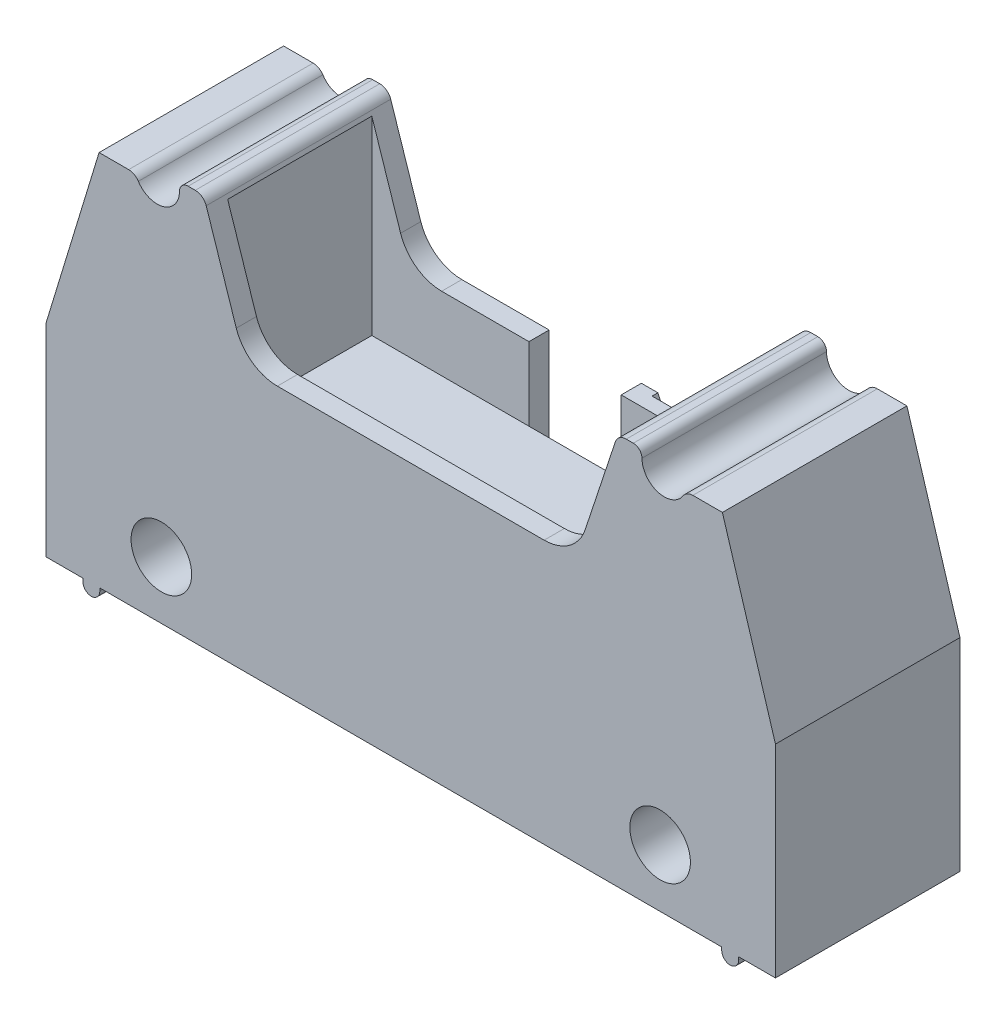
ISO-10303-21;
HEADER;
FILE_DESCRIPTION(('STEP AP214'),'2;1');
FILE_NAME('part.step','',(''),(''),'','','');
FILE_SCHEMA(('AUTOMOTIVE_DESIGN { 1 0 10303 214 1 1 1 1 }'));
ENDSEC;
DATA;
#1=APPLICATION_CONTEXT('core data for automotive mechanical design processes');
#2=APPLICATION_PROTOCOL_DEFINITION('international standard','automotive_design',2000,#1);
#3=PRODUCT_CONTEXT('',#1,'mechanical');
#4=PRODUCT('Part','Part','',(#3));
#5=PRODUCT_RELATED_PRODUCT_CATEGORY('part','',(#4));
#6=PRODUCT_DEFINITION_FORMATION('','',#4);
#7=PRODUCT_DEFINITION_CONTEXT('part definition',#1,'design');
#8=PRODUCT_DEFINITION('design','',#6,#7);
#9=PRODUCT_DEFINITION_SHAPE('','',#8);
#10=(LENGTH_UNIT() NAMED_UNIT(*) SI_UNIT(.MILLI.,.METRE.));
#11=(NAMED_UNIT(*) PLANE_ANGLE_UNIT() SI_UNIT($,.RADIAN.));
#12=(NAMED_UNIT(*) SI_UNIT($,.STERADIAN.) SOLID_ANGLE_UNIT());
#13=UNCERTAINTY_MEASURE_WITH_UNIT(LENGTH_MEASURE(1.E-05),#10,'distance_accuracy_value','');
#14=(GEOMETRIC_REPRESENTATION_CONTEXT(3) GLOBAL_UNCERTAINTY_ASSIGNED_CONTEXT((#13)) GLOBAL_UNIT_ASSIGNED_CONTEXT((#10,
#11,#12)) REPRESENTATION_CONTEXT('',''));
#15=CARTESIAN_POINT('',(0.,0.,0.));
#16=DIRECTION('',(0.,0.,1.));
#17=DIRECTION('',(1.,0.,0.));
#18=AXIS2_PLACEMENT_3D('',#15,#16,#17);
#19=CARTESIAN_POINT('',(0.,11.6087091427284,4.064));
#20=DIRECTION('',(0.,1.,0.));
#21=DIRECTION('',(-1.,0.,0.));
#22=AXIS2_PLACEMENT_3D('',#19,#20,#21);
#23=PLANE('',#22);
#24=DIRECTION('',(0.,0.,-1.));
#25=VECTOR('',#24,1.);
#26=CARTESIAN_POINT('',(-2.032,11.6087091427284,4.56275873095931));
#27=LINE('',#26,#25);
#28=CARTESIAN_POINT('',(-2.032,11.6087091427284,-3.175));
#29=VERTEX_POINT('',#28);
#30=CARTESIAN_POINT('',(-2.032,11.6087091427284,-4.064));
#31=VERTEX_POINT('',#30);
#32=EDGE_CURVE('E1168',#29,#31,#27,.T.);
#33=ORIENTED_EDGE('',*,*,#32,.T.);
#34=DIRECTION('',(1.,0.,0.));
#35=VECTOR('',#34,1.);
#36=CARTESIAN_POINT('',(0.,11.6087091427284,-4.064));
#37=LINE('',#36,#35);
#38=CARTESIAN_POINT('',(-5.87674794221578,11.6087091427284,-4.064));
#39=VERTEX_POINT('',#38);
#40=EDGE_CURVE('E856',#39,#31,#37,.T.);
#41=ORIENTED_EDGE('',*,*,#40,.F.);
#42=DIRECTION('',(0.,0.,-1.));
#43=VECTOR('',#42,1.);
#44=CARTESIAN_POINT('',(-5.87674794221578,11.6087091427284,4.064));
#45=LINE('',#44,#43);
#46=CARTESIAN_POINT('',(-5.87674794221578,11.6087091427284,-3.175));
#47=VERTEX_POINT('',#46);
#48=EDGE_CURVE('E584',#47,#39,#45,.T.);
#49=ORIENTED_EDGE('',*,*,#48,.F.);
#50=DIRECTION('',(-1.,0.,0.));
#51=VECTOR('',#50,1.);
#52=CARTESIAN_POINT('',(0.,11.6087091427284,-3.175));
#53=LINE('',#52,#51);
#54=EDGE_CURVE('E1169',#29,#47,#53,.T.);
#55=ORIENTED_EDGE('',*,*,#54,.F.);
#56=EDGE_LOOP('',(#33,#41,#49,#55));
#57=FACE_BOUND('',#56,.T.);
#58=ADVANCED_FACE('F42',(#57),#23,.T.);
#59=CARTESIAN_POINT('',(8.95350000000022,8.38199999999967,-3.175));
#60=DIRECTION('',(0.,0.,-1.));
#61=DIRECTION('',(-1.,0.,0.));
#62=AXIS2_PLACEMENT_3D('',#59,#60,#61);
#63=PLANE('',#62);
#64=DIRECTION('',(-1.,-3.88658657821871E-13,0.));
#65=VECTOR('',#64,1.);
#66=CARTESIAN_POINT('',(8.95350000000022,8.38199999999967,-3.175));
#67=LINE('',#66,#65);
#68=CARTESIAN_POINT('',(-2.032,8.38199999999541,-3.175));
#69=VERTEX_POINT('',#68);
#70=CARTESIAN_POINT('',(-8.95350000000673,8.38199999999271,-3.175));
#71=VERTEX_POINT('',#70);
#72=EDGE_CURVE('E1297',#69,#71,#67,.T.);
#73=ORIENTED_EDGE('',*,*,#72,.F.);
#74=DIRECTION('',(0.,-1.,0.));
#75=VECTOR('',#74,1.);
#76=CARTESIAN_POINT('',(-2.032,5.65912,-3.175));
#77=LINE('',#76,#75);
#78=EDGE_CURVE('E61',#29,#69,#77,.T.);
#79=ORIENTED_EDGE('',*,*,#78,.F.);
#80=ORIENTED_EDGE('',*,*,#54,.T.);
#81=CARTESIAN_POINT('',(-5.87674794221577,13.5137091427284,-3.175));
#82=DIRECTION('',(0.,0.,-1.));
#83=DIRECTION('',(-1.,0.,0.));
#84=AXIS2_PLACEMENT_3D('',#81,#82,#83);
#85=CIRCLE('',#84,1.905);
#86=CARTESIAN_POINT('',(-7.68549622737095,12.9158340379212,-3.175));
#87=VERTEX_POINT('',#86);
#88=EDGE_CURVE('E1318',#87,#47,#85,.F.);
#89=ORIENTED_EDGE('',*,*,#88,.F.);
#90=DIRECTION('',(0.313845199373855,-0.949474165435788,0.));
#91=VECTOR('',#90,1.);
#92=CARTESIAN_POINT('',(2.84412461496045,-18.939370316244,-3.175));
#93=LINE('',#92,#91);
#94=CARTESIAN_POINT('',(-8.95350000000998,16.7519189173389,-3.175));
#95=VERTEX_POINT('',#94);
#96=EDGE_CURVE('E1162',#95,#87,#93,.T.);
#97=ORIENTED_EDGE('',*,*,#96,.F.);
#98=DIRECTION('',(-3.88467986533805E-13,1.,0.));
#99=VECTOR('',#98,1.);
#100=CARTESIAN_POINT('',(-8.95350000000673,8.38199999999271,-3.175));
#101=LINE('',#100,#99);
#102=EDGE_CURVE('E1309',#71,#95,#101,.T.);
#103=ORIENTED_EDGE('',*,*,#102,.F.);
#104=EDGE_LOOP('',(#73,#79,#80,#89,#97,#103));
#105=FACE_BOUND('',#104,.T.);
#106=ADVANCED_FACE('F747',(#105),#63,.F.);
#107=DIRECTION('',(1.,0.,0.));
#108=VECTOR('',#107,1.);
#109=CARTESIAN_POINT('',(0.,11.6087091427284,3.175));
#110=LINE('',#109,#108);
#111=CARTESIAN_POINT('',(-5.87674794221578,11.6087091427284,3.175));
#112=VERTEX_POINT('',#111);
#113=CARTESIAN_POINT('',(5.87674794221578,11.6087091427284,3.175));
#114=VERTEX_POINT('',#113);
#115=EDGE_CURVE('E761',#112,#114,#110,.T.);
#116=ORIENTED_EDGE('',*,*,#115,.F.);
#117=CARTESIAN_POINT('',(-5.87674794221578,11.6087091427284,4.064));
#118=VERTEX_POINT('',#117);
#119=EDGE_CURVE('E585',#118,#112,#45,.T.);
#120=ORIENTED_EDGE('',*,*,#119,.F.);
#121=DIRECTION('',(1.,0.,0.));
#122=VECTOR('',#121,1.);
#123=CARTESIAN_POINT('',(0.,11.6087091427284,4.064));
#124=LINE('',#123,#122);
#125=CARTESIAN_POINT('',(5.87674794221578,11.6087091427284,4.064));
#126=VERTEX_POINT('',#125);
#127=EDGE_CURVE('E776',#118,#126,#124,.T.);
#128=ORIENTED_EDGE('',*,*,#127,.T.);
#129=DIRECTION('',(0.,0.,-1.));
#130=VECTOR('',#129,1.);
#131=CARTESIAN_POINT('',(5.87674794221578,11.6087091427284,4.064));
#132=LINE('',#131,#130);
#133=EDGE_CURVE('E501',#126,#114,#132,.T.);
#134=ORIENTED_EDGE('',*,*,#133,.T.);
#135=EDGE_LOOP('',(#116,#120,#128,#134));
#136=FACE_BOUND('',#135,.T.);
#137=ADVANCED_FACE('F742',(#136),#23,.T.);
#138=CARTESIAN_POINT('',(-5.87674794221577,13.5137091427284,4.064));
#139=DIRECTION('',(0.,0.,-1.));
#140=DIRECTION('',(-1.,0.,0.));
#141=AXIS2_PLACEMENT_3D('',#138,#139,#140);
#142=CYLINDRICAL_SURFACE('',#141,1.905);
#143=ORIENTED_EDGE('',*,*,#119,.T.);
#144=CARTESIAN_POINT('',(-5.87674794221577,13.5137091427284,3.175));
#145=DIRECTION('',(0.,0.,1.));
#146=DIRECTION('',(1.,0.,0.));
#147=AXIS2_PLACEMENT_3D('',#144,#145,#146);
#148=CIRCLE('',#147,1.905);
#149=CARTESIAN_POINT('',(-7.68549622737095,12.9158340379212,3.175));
#150=VERTEX_POINT('',#149);
#151=EDGE_CURVE('E766',#112,#150,#148,.F.);
#152=ORIENTED_EDGE('',*,*,#151,.T.);
#153=DIRECTION('',(0.,0.,-1.));
#154=VECTOR('',#153,1.);
#155=CARTESIAN_POINT('',(-7.68549622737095,12.9158340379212,4.064));
#156=LINE('',#155,#154);
#157=CARTESIAN_POINT('',(-7.68549622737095,12.9158340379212,4.064));
#158=VERTEX_POINT('',#157);
#159=EDGE_CURVE('E581',#158,#150,#156,.T.);
#160=ORIENTED_EDGE('',*,*,#159,.F.);
#161=CARTESIAN_POINT('',(-5.87674794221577,13.5137091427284,4.064));
#162=DIRECTION('',(0.,0.,1.));
#163=DIRECTION('',(1.,0.,0.));
#164=AXIS2_PLACEMENT_3D('',#161,#162,#163);
#165=CIRCLE('',#164,1.905);
#166=EDGE_CURVE('E771',#118,#158,#165,.F.);
#167=ORIENTED_EDGE('',*,*,#166,.F.);
#168=EDGE_LOOP('',(#143,#152,#160,#167));
#169=FACE_BOUND('',#168,.T.);
#170=ADVANCED_FACE('F737',(#169),#142,.F.);
#171=CARTESIAN_POINT('',(5.87674794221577,13.5137091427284,4.064));
#172=DIRECTION('',(0.,0.,-1.));
#173=DIRECTION('',(-1.,0.,0.));
#174=AXIS2_PLACEMENT_3D('',#171,#172,#173);
#175=CYLINDRICAL_SURFACE('',#174,1.905);
#176=CARTESIAN_POINT('',(5.87674794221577,13.5137091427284,3.175));
#177=DIRECTION('',(0.,0.,1.));
#178=DIRECTION('',(1.,0.,0.));
#179=AXIS2_PLACEMENT_3D('',#176,#177,#178);
#180=CIRCLE('',#179,1.905);
#181=CARTESIAN_POINT('',(7.68549622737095,12.9158340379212,3.175));
#182=VERTEX_POINT('',#181);
#183=EDGE_CURVE('E590',#114,#182,#180,.T.);
#184=ORIENTED_EDGE('',*,*,#183,.F.);
#185=ORIENTED_EDGE('',*,*,#133,.F.);
#186=CARTESIAN_POINT('',(5.87674794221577,13.5137091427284,4.064));
#187=DIRECTION('',(0.,0.,1.));
#188=DIRECTION('',(1.,0.,0.));
#189=AXIS2_PLACEMENT_3D('',#186,#187,#188);
#190=CIRCLE('',#189,1.905);
#191=CARTESIAN_POINT('',(7.68549622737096,12.9158340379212,4.064));
#192=VERTEX_POINT('',#191);
#193=EDGE_CURVE('E502',#126,#192,#190,.T.);
#194=ORIENTED_EDGE('',*,*,#193,.T.);
#195=DIRECTION('',(0.,0.,-1.));
#196=VECTOR('',#195,1.);
#197=CARTESIAN_POINT('',(7.68549622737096,12.9158340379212,4.064));
#198=LINE('',#197,#196);
#199=EDGE_CURVE('E512',#192,#182,#198,.T.);
#200=ORIENTED_EDGE('',*,*,#199,.T.);
#201=EDGE_LOOP('',(#184,#185,#194,#200));
#202=FACE_BOUND('',#201,.T.);
#203=ADVANCED_FACE('F619',(#202),#175,.F.);
#204=CARTESIAN_POINT('',(0.,-19.8794852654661,4.064));
#205=DIRECTION('',(0.,0.,1.));
#206=DIRECTION('',(1.,0.,0.));
#207=AXIS2_PLACEMENT_3D('',#204,#205,#206);
#208=PLANE('',#207);
#209=CARTESIAN_POINT('',(-10.9855,2.54,4.064));
#210=DIRECTION('',(0.,0.,1.));
#211=DIRECTION('',(1.,0.,0.));
#212=AXIS2_PLACEMENT_3D('',#209,#210,#211);
#213=CIRCLE('',#212,1.33440502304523);
#214=CARTESIAN_POINT('',(-9.65109497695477,2.54,4.064));
#215=VERTEX_POINT('',#214);
#216=EDGE_CURVE('E1329',#215,#215,#213,.T.);
#217=ORIENTED_EDGE('',*,*,#216,.F.);
#218=EDGE_LOOP('',(#217));
#219=FACE_BOUND('',#218,.T.);
#220=ORIENTED_EDGE('',*,*,#127,.F.);
#221=ORIENTED_EDGE('',*,*,#166,.T.);
#222=DIRECTION('',(-0.313845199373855,0.949474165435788,0.));
#223=VECTOR('',#222,1.);
#224=CARTESIAN_POINT('',(2.84412461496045,-18.939370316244,4.064));
#225=LINE('',#224,#223);
#226=CARTESIAN_POINT('',(-9.01019346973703,16.9234333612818,4.064));
#227=VERTEX_POINT('',#226);
#228=EDGE_CURVE('E775',#158,#227,#225,.T.);
#229=ORIENTED_EDGE('',*,*,#228,.T.);
#230=CARTESIAN_POINT('',(-9.49252634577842,16.764,4.064));
#231=DIRECTION('',(0.,0.,1.));
#232=DIRECTION('',(1.,0.,0.));
#233=AXIS2_PLACEMENT_3D('',#230,#231,#232);
#234=CIRCLE('',#233,0.507999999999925);
#235=CARTESIAN_POINT('',(-9.49252634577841,17.2719999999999,4.064));
#236=VERTEX_POINT('',#235);
#237=EDGE_CURVE('E788',#227,#236,#234,.T.);
#238=ORIENTED_EDGE('',*,*,#237,.T.);
#239=DIRECTION('',(-1.,3.88467986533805E-13,0.));
#240=VECTOR('',#239,1.);
#241=CARTESIAN_POINT('',(1.44384861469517E-11,17.2719999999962,4.064));
#242=LINE('',#241,#240);
#243=CARTESIAN_POINT('',(-9.80511489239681,17.272,4.064));
#244=VERTEX_POINT('',#243);
#245=EDGE_CURVE('E790',#236,#244,#242,.T.);
#246=ORIENTED_EDGE('',*,*,#245,.T.);
#247=CARTESIAN_POINT('',(-9.80511489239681,16.891,4.064));
#248=DIRECTION('',(0.,0.,1.));
#249=DIRECTION('',(1.,0.,0.));
#250=AXIS2_PLACEMENT_3D('',#247,#248,#249);
#251=CIRCLE('',#250,0.381000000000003);
#252=CARTESIAN_POINT('',(-10.1861148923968,16.891,4.064));
#253=VERTEX_POINT('',#252);
#254=EDGE_CURVE('E792',#253,#244,#251,.F.);
#255=ORIENTED_EDGE('',*,*,#254,.F.);
#256=CARTESIAN_POINT('',(-11.1701632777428,16.891,4.064));
#257=DIRECTION('',(0.,0.,1.));
#258=DIRECTION('',(1.,0.,0.));
#259=AXIS2_PLACEMENT_3D('',#256,#257,#258);
#260=CIRCLE('',#259,0.984048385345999);
#261=CARTESIAN_POINT('',(-11.9986249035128,16.3599608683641,4.064));
#262=VERTEX_POINT('',#261);
#263=EDGE_CURVE('E795',#253,#262,#260,.F.);
#264=ORIENTED_EDGE('',*,*,#263,.T.);
#265=CARTESIAN_POINT('',(-12.4263056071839,16.08582,4.064));
#266=DIRECTION('',(0.,0.,1.));
#267=DIRECTION('',(1.,0.,0.));
#268=AXIS2_PLACEMENT_3D('',#265,#266,#267);
#269=CIRCLE('',#268,0.507999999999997);
#270=CARTESIAN_POINT('',(-12.4263056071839,16.59382,4.064));
#271=VERTEX_POINT('',#270);
#272=EDGE_CURVE('E797',#271,#262,#269,.F.);
#273=ORIENTED_EDGE('',*,*,#272,.F.);
#274=DIRECTION('',(1.,0.,0.));
#275=VECTOR('',#274,1.);
#276=CARTESIAN_POINT('',(1.03478307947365E-13,16.59382,4.064));
#277=LINE('',#276,#275);
#278=CARTESIAN_POINT('',(-13.7287852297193,16.59382,4.064));
#279=VERTEX_POINT('',#278);
#280=EDGE_CURVE('E800',#279,#271,#277,.T.);
#281=ORIENTED_EDGE('',*,*,#280,.F.);
#282=DIRECTION('',(0.291403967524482,0.956600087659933,0.));
#283=VECTOR('',#282,1.);
#284=CARTESIAN_POINT('',(-22.7301793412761,-12.9553123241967,4.064));
#285=LINE('',#284,#283);
#286=CARTESIAN_POINT('',(-16.0655,8.92302,4.064));
#287=VERTEX_POINT('',#286);
#288=EDGE_CURVE('E803',#287,#279,#285,.T.);
#289=ORIENTED_EDGE('',*,*,#288,.F.);
#290=DIRECTION('',(0.,1.,0.));
#291=VECTOR('',#290,1.);
#292=CARTESIAN_POINT('',(-16.0655,-19.8794852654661,4.064));
#293=LINE('',#292,#291);
#294=CARTESIAN_POINT('',(-16.0655,0.,4.064));
#295=VERTEX_POINT('',#294);
#296=EDGE_CURVE('E806',#295,#287,#293,.T.);
#297=ORIENTED_EDGE('',*,*,#296,.F.);
#298=DIRECTION('',(1.,0.,0.));
#299=VECTOR('',#298,1.);
#300=CARTESIAN_POINT('',(0.,0.,4.064));
#301=LINE('',#300,#299);
#302=CARTESIAN_POINT('',(-14.44498,0.,4.064));
#303=VERTEX_POINT('',#302);
#304=EDGE_CURVE('E809',#295,#303,#301,.T.);
#305=ORIENTED_EDGE('',*,*,#304,.T.);
#306=DIRECTION('',(0.,1.,0.));
#307=VECTOR('',#306,1.);
#308=CARTESIAN_POINT('',(-14.4449800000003,-19.8794852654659,4.064));
#309=LINE('',#308,#307);
#310=CARTESIAN_POINT('',(-14.44498,-0.126999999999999,4.064));
#311=VERTEX_POINT('',#310);
#312=EDGE_CURVE('E811',#311,#303,#309,.T.);
#313=ORIENTED_EDGE('',*,*,#312,.F.);
#314=CARTESIAN_POINT('',(-14.06398,-0.127,4.064));
#315=DIRECTION('',(0.,0.,1.));
#316=DIRECTION('',(1.,0.,0.));
#317=AXIS2_PLACEMENT_3D('',#314,#315,#316);
#318=CIRCLE('',#317,0.381000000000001);
#319=CARTESIAN_POINT('',(-14.0716,-0.507923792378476,4.064));
#320=VERTEX_POINT('',#319);
#321=EDGE_CURVE('E814',#320,#311,#318,.F.);
#322=ORIENTED_EDGE('',*,*,#321,.F.);
#323=CARTESIAN_POINT('',(-14.07922,-0.127,4.064));
#324=DIRECTION('',(0.,0.,1.));
#325=DIRECTION('',(1.,0.,0.));
#326=AXIS2_PLACEMENT_3D('',#323,#324,#325);
#327=CIRCLE('',#326,0.381000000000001);
#328=CARTESIAN_POINT('',(-13.69822,-0.126999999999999,4.064));
#329=VERTEX_POINT('',#328);
#330=EDGE_CURVE('E817',#320,#329,#327,.T.);
#331=ORIENTED_EDGE('',*,*,#330,.T.);
#332=DIRECTION('',(0.,-1.,0.));
#333=VECTOR('',#332,1.);
#334=CARTESIAN_POINT('',(-13.6982199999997,-19.8794852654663,4.064));
#335=LINE('',#334,#333);
#336=CARTESIAN_POINT('',(-13.69822,0.,4.064));
#337=VERTEX_POINT('',#336);
#338=EDGE_CURVE('E819',#337,#329,#335,.T.);
#339=ORIENTED_EDGE('',*,*,#338,.F.);
#340=DIRECTION('',(1.,0.,0.));
#341=VECTOR('',#340,1.);
#342=CARTESIAN_POINT('',(0.,0.,4.064));
#343=LINE('',#342,#341);
#344=CARTESIAN_POINT('',(13.69822,0.,4.064));
#345=VERTEX_POINT('',#344);
#346=EDGE_CURVE('E822',#337,#345,#343,.T.);
#347=ORIENTED_EDGE('',*,*,#346,.T.);
#348=DIRECTION('',(0.,-1.,0.));
#349=VECTOR('',#348,1.);
#350=CARTESIAN_POINT('',(13.6982199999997,-19.8794852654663,4.064));
#351=LINE('',#350,#349);
#352=CARTESIAN_POINT('',(13.69822,-0.126999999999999,4.064));
#353=VERTEX_POINT('',#352);
#354=EDGE_CURVE('E824',#345,#353,#351,.T.);
#355=ORIENTED_EDGE('',*,*,#354,.T.);
#356=CARTESIAN_POINT('',(14.07922,-0.127,4.064));
#357=DIRECTION('',(0.,0.,1.));
#358=DIRECTION('',(1.,0.,0.));
#359=AXIS2_PLACEMENT_3D('',#356,#357,#358);
#360=CIRCLE('',#359,0.381000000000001);
#361=CARTESIAN_POINT('',(14.0716,-0.507923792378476,4.064));
#362=VERTEX_POINT('',#361);
#363=EDGE_CURVE('E826',#362,#353,#360,.F.);
#364=ORIENTED_EDGE('',*,*,#363,.F.);
#365=CARTESIAN_POINT('',(14.06398,-0.127,4.064));
#366=DIRECTION('',(0.,0.,1.));
#367=DIRECTION('',(1.,0.,0.));
#368=AXIS2_PLACEMENT_3D('',#365,#366,#367);
#369=CIRCLE('',#368,0.381000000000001);
#370=CARTESIAN_POINT('',(14.44498,-0.126999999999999,4.064));
#371=VERTEX_POINT('',#370);
#372=EDGE_CURVE('E829',#362,#371,#369,.T.);
#373=ORIENTED_EDGE('',*,*,#372,.T.);
#374=DIRECTION('',(0.,1.,0.));
#375=VECTOR('',#374,1.);
#376=CARTESIAN_POINT('',(14.4449800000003,-19.8794852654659,4.064));
#377=LINE('',#376,#375);
#378=CARTESIAN_POINT('',(14.44498,0.,4.064));
#379=VERTEX_POINT('',#378);
#380=EDGE_CURVE('E831',#371,#379,#377,.T.);
#381=ORIENTED_EDGE('',*,*,#380,.T.);
#382=DIRECTION('',(1.,0.,0.));
#383=VECTOR('',#382,1.);
#384=CARTESIAN_POINT('',(0.,0.,4.064));
#385=LINE('',#384,#383);
#386=CARTESIAN_POINT('',(16.0655,0.,4.064));
#387=VERTEX_POINT('',#386);
#388=EDGE_CURVE('E833',#379,#387,#385,.T.);
#389=ORIENTED_EDGE('',*,*,#388,.T.);
#390=DIRECTION('',(0.,1.,0.));
#391=VECTOR('',#390,1.);
#392=CARTESIAN_POINT('',(16.0655,-19.8794852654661,4.064));
#393=LINE('',#392,#391);
#394=CARTESIAN_POINT('',(16.0655,8.92302,4.064));
#395=VERTEX_POINT('',#394);
#396=EDGE_CURVE('E835',#387,#395,#393,.T.);
#397=ORIENTED_EDGE('',*,*,#396,.T.);
#398=DIRECTION('',(-0.291403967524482,0.956600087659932,0.));
#399=VECTOR('',#398,1.);
#400=CARTESIAN_POINT('',(22.7301793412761,-12.9553123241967,4.064));
#401=LINE('',#400,#399);
#402=CARTESIAN_POINT('',(13.7287852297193,16.59382,4.064));
#403=VERTEX_POINT('',#402);
#404=EDGE_CURVE('E837',#395,#403,#401,.T.);
#405=ORIENTED_EDGE('',*,*,#404,.T.);
#406=DIRECTION('',(-1.,0.,0.));
#407=VECTOR('',#406,1.);
#408=CARTESIAN_POINT('',(0.,16.59382,4.064));
#409=LINE('',#408,#407);
#410=CARTESIAN_POINT('',(12.4263056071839,16.59382,4.064));
#411=VERTEX_POINT('',#410);
#412=EDGE_CURVE('E839',#403,#411,#409,.T.);
#413=ORIENTED_EDGE('',*,*,#412,.T.);
#414=CARTESIAN_POINT('',(12.4263056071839,16.08582,4.064));
#415=DIRECTION('',(0.,0.,1.));
#416=DIRECTION('',(1.,0.,0.));
#417=AXIS2_PLACEMENT_3D('',#414,#415,#416);
#418=CIRCLE('',#417,0.507999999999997);
#419=CARTESIAN_POINT('',(11.9986249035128,16.3599608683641,4.064));
#420=VERTEX_POINT('',#419);
#421=EDGE_CURVE('E841',#411,#420,#418,.T.);
#422=ORIENTED_EDGE('',*,*,#421,.T.);
#423=CARTESIAN_POINT('',(11.1701632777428,16.891,4.064));
#424=DIRECTION('',(0.,0.,1.));
#425=DIRECTION('',(1.,0.,0.));
#426=AXIS2_PLACEMENT_3D('',#423,#424,#425);
#427=CIRCLE('',#426,0.984048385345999);
#428=CARTESIAN_POINT('',(10.1861148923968,16.891,4.064));
#429=VERTEX_POINT('',#428);
#430=EDGE_CURVE('E843',#429,#420,#427,.T.);
#431=ORIENTED_EDGE('',*,*,#430,.F.);
#432=CARTESIAN_POINT('',(9.80511489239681,16.891,4.064));
#433=DIRECTION('',(0.,0.,1.));
#434=DIRECTION('',(1.,0.,0.));
#435=AXIS2_PLACEMENT_3D('',#432,#433,#434);
#436=CIRCLE('',#435,0.381000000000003);
#437=CARTESIAN_POINT('',(9.80511489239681,17.272,4.064));
#438=VERTEX_POINT('',#437);
#439=EDGE_CURVE('E846',#429,#438,#436,.T.);
#440=ORIENTED_EDGE('',*,*,#439,.T.);
#441=DIRECTION('',(1.,3.88467986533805E-13,0.));
#442=VECTOR('',#441,1.);
#443=CARTESIAN_POINT('',(-1.44258392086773E-11,17.2719999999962,4.064));
#444=LINE('',#443,#442);
#445=CARTESIAN_POINT('',(9.49252634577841,17.2719999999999,4.064));
#446=VERTEX_POINT('',#445);
#447=EDGE_CURVE('E848',#446,#438,#444,.T.);
#448=ORIENTED_EDGE('',*,*,#447,.F.);
#449=CARTESIAN_POINT('',(9.49252634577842,16.764,4.064));
#450=DIRECTION('',(0.,0.,1.));
#451=DIRECTION('',(1.,0.,0.));
#452=AXIS2_PLACEMENT_3D('',#449,#450,#451);
#453=CIRCLE('',#452,0.507999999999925);
#454=CARTESIAN_POINT('',(9.01019346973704,16.9234333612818,4.064));
#455=VERTEX_POINT('',#454);
#456=EDGE_CURVE('E851',#455,#446,#453,.F.);
#457=ORIENTED_EDGE('',*,*,#456,.F.);
#458=DIRECTION('',(0.313845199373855,0.949474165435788,0.));
#459=VECTOR('',#458,1.);
#460=CARTESIAN_POINT('',(-2.84412461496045,-18.939370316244,4.064));
#461=LINE('',#460,#459);
#462=EDGE_CURVE('E507',#192,#455,#461,.T.);
#463=ORIENTED_EDGE('',*,*,#462,.F.);
#464=ORIENTED_EDGE('',*,*,#193,.F.);
#465=EDGE_LOOP('',(#220,#221,#229,#238,#246,#255,#264,#273,#281,#289,#297,#305,#313,#322,#331,
#339,#347,#355,#364,#373,#381,#389,#397,#405,#413,#422,#431,#440,#448,#457,#463,#464));
#466=FACE_BOUND('',#465,.T.);
#467=CARTESIAN_POINT('',(10.9855,2.54,4.064));
#468=DIRECTION('',(0.,0.,1.));
#469=DIRECTION('',(1.,0.,0.));
#470=AXIS2_PLACEMENT_3D('',#467,#468,#469);
#471=CIRCLE('',#470,1.33440502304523);
#472=CARTESIAN_POINT('',(12.3199050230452,2.54,4.064));
#473=VERTEX_POINT('',#472);
#474=EDGE_CURVE('E1332',#473,#473,#471,.F.);
#475=ORIENTED_EDGE('',*,*,#474,.T.);
#476=EDGE_LOOP('',(#475));
#477=FACE_BOUND('',#476,.T.);
#478=ADVANCED_FACE('F613',(#219,#466,#477),#208,.T.);
#479=CARTESIAN_POINT('',(10.9855,5.8166,-2.794));
#480=DIRECTION('',(0.,0.,-1.));
#481=DIRECTION('',(-1.,0.,0.));
#482=AXIS2_PLACEMENT_3D('',#479,#480,#481);
#483=PLANE('',#482);
#484=DIRECTION('',(0.707106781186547,0.707106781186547,0.));
#485=VECTOR('',#484,1.);
#486=CARTESIAN_POINT('',(10.9855,5.8166,-2.794));
#487=LINE('',#486,#485);
#488=CARTESIAN_POINT('',(8.4836,3.3147,-2.794));
#489=VERTEX_POINT('',#488);
#490=CARTESIAN_POINT('',(10.9855,5.8166,-2.794));
#491=VERTEX_POINT('',#490);
#492=EDGE_CURVE('E1004',#489,#491,#487,.T.);
#493=ORIENTED_EDGE('',*,*,#492,.T.);
#494=DIRECTION('',(0.707106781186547,-0.707106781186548,0.));
#495=VECTOR('',#494,1.);
#496=CARTESIAN_POINT('',(13.4874,3.3147,-2.794));
#497=LINE('',#496,#495);
#498=CARTESIAN_POINT('',(13.4874,3.3147,-2.794));
#499=VERTEX_POINT('',#498);
#500=EDGE_CURVE('E1007',#491,#499,#497,.T.);
#501=ORIENTED_EDGE('',*,*,#500,.T.);
#502=DIRECTION('',(0.,-1.,0.));
#503=VECTOR('',#502,1.);
#504=CARTESIAN_POINT('',(13.4874,0.,-2.794));
#505=LINE('',#504,#503);
#506=CARTESIAN_POINT('',(13.4874,0.,-2.794));
#507=VERTEX_POINT('',#506);
#508=EDGE_CURVE('E1340',#499,#507,#505,.T.);
#509=ORIENTED_EDGE('',*,*,#508,.T.);
#510=DIRECTION('',(-1.,0.,0.));
#511=VECTOR('',#510,1.);
#512=CARTESIAN_POINT('',(13.4874,0.,-2.794));
#513=LINE('',#512,#511);
#514=CARTESIAN_POINT('',(8.4836,0.,-2.794));
#515=VERTEX_POINT('',#514);
#516=EDGE_CURVE('E1343',#507,#515,#513,.T.);
#517=ORIENTED_EDGE('',*,*,#516,.T.);
#518=DIRECTION('',(0.,1.,0.));
#519=VECTOR('',#518,1.);
#520=CARTESIAN_POINT('',(8.4836,3.3147,-2.794));
#521=LINE('',#520,#519);
#522=EDGE_CURVE('E1024',#515,#489,#521,.T.);
#523=ORIENTED_EDGE('',*,*,#522,.T.);
#524=EDGE_LOOP('',(#493,#501,#509,#517,#523));
#525=FACE_BOUND('',#524,.T.);
#526=CARTESIAN_POINT('',(10.9855,2.54,-2.794));
#527=DIRECTION('',(0.,0.,-1.));
#528=DIRECTION('',(-1.,0.,0.));
#529=AXIS2_PLACEMENT_3D('',#526,#527,#528);
#530=CIRCLE('',#529,1.33440502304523);
#531=CARTESIAN_POINT('',(9.65109497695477,2.54,-2.794));
#532=VERTEX_POINT('',#531);
#533=EDGE_CURVE('E1335',#532,#532,#530,.T.);
#534=ORIENTED_EDGE('',*,*,#533,.F.);
#535=EDGE_LOOP('',(#534));
#536=FACE_BOUND('',#535,.T.);
#537=ADVANCED_FACE('F741',(#525,#536),#483,.T.);
#538=DIRECTION('',(0.,0.,-1.));
#539=VECTOR('',#538,1.);
#540=CARTESIAN_POINT('',(2.75762794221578,11.6087091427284,-3.81));
#541=LINE('',#540,#539);
#542=CARTESIAN_POINT('',(2.75762794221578,11.6087091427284,-3.81));
#543=VERTEX_POINT('',#542);
#544=CARTESIAN_POINT('',(2.75762794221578,11.6087091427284,-4.064));
#545=VERTEX_POINT('',#544);
#546=EDGE_CURVE('E1619',#543,#545,#541,.T.);
#547=ORIENTED_EDGE('',*,*,#546,.T.);
#548=CARTESIAN_POINT('',(2.032,11.6087091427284,-4.064));
#549=VERTEX_POINT('',#548);
#550=EDGE_CURVE('E860',#549,#545,#37,.T.);
#551=ORIENTED_EDGE('',*,*,#550,.F.);
#552=DIRECTION('',(0.,0.,-1.));
#553=VECTOR('',#552,1.);
#554=CARTESIAN_POINT('',(2.032,11.6087091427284,4.56275873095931));
#555=LINE('',#554,#553);
#556=CARTESIAN_POINT('',(2.032,11.6087091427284,-3.175));
#557=VERTEX_POINT('',#556);
#558=EDGE_CURVE('E1186',#557,#549,#555,.T.);
#559=ORIENTED_EDGE('',*,*,#558,.F.);
#560=CARTESIAN_POINT('',(5.87674794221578,11.6087091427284,-3.175));
#561=VERTEX_POINT('',#560);
#562=EDGE_CURVE('E500',#561,#557,#53,.T.);
#563=ORIENTED_EDGE('',*,*,#562,.F.);
#564=CARTESIAN_POINT('',(5.87674794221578,11.6087091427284,-3.81));
#565=VERTEX_POINT('',#564);
#566=EDGE_CURVE('E493',#561,#565,#132,.T.);
#567=ORIENTED_EDGE('',*,*,#566,.T.);
#568=DIRECTION('',(1.,0.,0.));
#569=VECTOR('',#568,1.);
#570=CARTESIAN_POINT('',(2.75762794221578,11.6087091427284,-3.81));
#571=LINE('',#570,#569);
#572=EDGE_CURVE('E480',#543,#565,#571,.T.);
#573=ORIENTED_EDGE('',*,*,#572,.F.);
#574=EDGE_LOOP('',(#547,#551,#559,#563,#567,#573));
#575=FACE_BOUND('',#574,.T.);
#576=ADVANCED_FACE('F44',(#575),#23,.T.);
#577=CARTESIAN_POINT('',(-7.68549622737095,12.9158340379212,-4.064));
#578=VERTEX_POINT('',#577);
#579=EDGE_CURVE('E580',#87,#578,#156,.T.);
#580=ORIENTED_EDGE('',*,*,#579,.F.);
#581=ORIENTED_EDGE('',*,*,#88,.T.);
#582=ORIENTED_EDGE('',*,*,#48,.T.);
#583=CARTESIAN_POINT('',(-5.87674794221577,13.5137091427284,-4.064));
#584=DIRECTION('',(0.,0.,1.));
#585=DIRECTION('',(1.,0.,0.));
#586=AXIS2_PLACEMENT_3D('',#583,#584,#585);
#587=CIRCLE('',#586,1.905);
#588=EDGE_CURVE('E859',#39,#578,#587,.F.);
#589=ORIENTED_EDGE('',*,*,#588,.T.);
#590=EDGE_LOOP('',(#580,#581,#582,#589));
#591=FACE_BOUND('',#590,.T.);
#592=ADVANCED_FACE('F733',(#591),#142,.F.);
#593=CARTESIAN_POINT('',(2.84412461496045,-18.939370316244,4.064));
#594=DIRECTION('',(-0.949474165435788,-0.313845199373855,0.));
#595=DIRECTION('',(0.313845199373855,-0.949474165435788,0.));
#596=AXIS2_PLACEMENT_3D('',#593,#594,#595);
#597=PLANE('',#596);
#598=ORIENTED_EDGE('',*,*,#159,.T.);
#599=DIRECTION('',(-0.313845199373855,0.949474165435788,0.));
#600=VECTOR('',#599,1.);
#601=CARTESIAN_POINT('',(2.84412461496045,-18.939370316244,3.175));
#602=LINE('',#601,#600);
#603=CARTESIAN_POINT('',(-8.95350000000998,16.7519189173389,3.175));
#604=VERTEX_POINT('',#603);
#605=EDGE_CURVE('E1323',#150,#604,#602,.T.);
#606=ORIENTED_EDGE('',*,*,#605,.T.);
#607=DIRECTION('',(0.,0.,-1.));
#608=VECTOR('',#607,1.);
#609=CARTESIAN_POINT('',(-8.95350000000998,16.7519189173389,4.064));
#610=LINE('',#609,#608);
#611=EDGE_CURVE('E12',#604,#95,#610,.T.);
#612=ORIENTED_EDGE('',*,*,#611,.T.);
#613=ORIENTED_EDGE('',*,*,#96,.T.);
#614=ORIENTED_EDGE('',*,*,#579,.T.);
#615=DIRECTION('',(-0.313845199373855,0.949474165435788,0.));
#616=VECTOR('',#615,1.);
#617=CARTESIAN_POINT('',(2.84412461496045,-18.939370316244,-4.064));
#618=LINE('',#617,#616);
#619=CARTESIAN_POINT('',(-9.01019346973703,16.9234333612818,-4.064));
#620=VERTEX_POINT('',#619);
#621=EDGE_CURVE('E863',#578,#620,#618,.T.);
#622=ORIENTED_EDGE('',*,*,#621,.T.);
#623=DIRECTION('',(0.,0.,-1.));
#624=VECTOR('',#623,1.);
#625=CARTESIAN_POINT('',(-9.01019346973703,16.9234333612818,4.064));
#626=LINE('',#625,#624);
#627=EDGE_CURVE('E577',#227,#620,#626,.T.);
#628=ORIENTED_EDGE('',*,*,#627,.F.);
#629=ORIENTED_EDGE('',*,*,#228,.F.);
#630=EDGE_LOOP('',(#598,#606,#612,#613,#614,#622,#628,#629));
#631=FACE_BOUND('',#630,.T.);
#632=ADVANCED_FACE('F730',(#631),#597,.F.);
#633=CARTESIAN_POINT('',(-9.49252634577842,16.764,4.064));
#634=DIRECTION('',(0.,0.,-1.));
#635=DIRECTION('',(-1.,0.,0.));
#636=AXIS2_PLACEMENT_3D('',#633,#634,#635);
#637=CYLINDRICAL_SURFACE('',#636,0.507999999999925);
#638=CARTESIAN_POINT('',(-9.49252634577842,16.764,-4.064));
#639=DIRECTION('',(0.,0.,1.));
#640=DIRECTION('',(1.,0.,0.));
#641=AXIS2_PLACEMENT_3D('',#638,#639,#640);
#642=CIRCLE('',#641,0.507999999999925);
#643=CARTESIAN_POINT('',(-9.49252634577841,17.2719999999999,-4.064));
#644=VERTEX_POINT('',#643);
#645=EDGE_CURVE('E865',#620,#644,#642,.T.);
#646=ORIENTED_EDGE('',*,*,#645,.T.);
#647=DIRECTION('',(0.,0.,-1.));
#648=VECTOR('',#647,1.);
#649=CARTESIAN_POINT('',(-9.49252634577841,17.2719999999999,4.064));
#650=LINE('',#649,#648);
#651=EDGE_CURVE('E574',#236,#644,#650,.T.);
#652=ORIENTED_EDGE('',*,*,#651,.F.);
#653=ORIENTED_EDGE('',*,*,#237,.F.);
#654=ORIENTED_EDGE('',*,*,#627,.T.);
#655=EDGE_LOOP('',(#646,#652,#653,#654));
#656=FACE_BOUND('',#655,.T.);
#657=ADVANCED_FACE('F726',(#656),#637,.T.);
#658=CARTESIAN_POINT('',(1.44384861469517E-11,17.2719999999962,4.064));
#659=DIRECTION('',(-3.88467986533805E-13,-1.,0.));
#660=DIRECTION('',(1.,-3.88467986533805E-13,0.));
#661=AXIS2_PLACEMENT_3D('',#658,#659,#660);
#662=PLANE('',#661);
#663=DIRECTION('',(-1.,3.88467986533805E-13,0.));
#664=VECTOR('',#663,1.);
#665=CARTESIAN_POINT('',(1.44384861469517E-11,17.2719999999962,-4.064));
#666=LINE('',#665,#664);
#667=CARTESIAN_POINT('',(-9.80511489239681,17.272,-4.064));
#668=VERTEX_POINT('',#667);
#669=EDGE_CURVE('E867',#644,#668,#666,.T.);
#670=ORIENTED_EDGE('',*,*,#669,.T.);
#671=DIRECTION('',(0.,0.,-1.));
#672=VECTOR('',#671,1.);
#673=CARTESIAN_POINT('',(-9.80511489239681,17.272,4.064));
#674=LINE('',#673,#672);
#675=EDGE_CURVE('E572',#244,#668,#674,.T.);
#676=ORIENTED_EDGE('',*,*,#675,.F.);
#677=ORIENTED_EDGE('',*,*,#245,.F.);
#678=ORIENTED_EDGE('',*,*,#651,.T.);
#679=EDGE_LOOP('',(#670,#676,#677,#678));
#680=FACE_BOUND('',#679,.T.);
#681=ADVANCED_FACE('F722',(#680),#662,.F.);
#682=CARTESIAN_POINT('',(-9.80511489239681,16.891,4.064));
#683=DIRECTION('',(0.,0.,-1.));
#684=DIRECTION('',(-1.,0.,0.));
#685=AXIS2_PLACEMENT_3D('',#682,#683,#684);
#686=CYLINDRICAL_SURFACE('',#685,0.381000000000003);
#687=CARTESIAN_POINT('',(-9.80511489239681,16.891,-4.064));
#688=DIRECTION('',(0.,0.,1.));
#689=DIRECTION('',(1.,0.,0.));
#690=AXIS2_PLACEMENT_3D('',#687,#688,#689);
#691=CIRCLE('',#690,0.381000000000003);
#692=CARTESIAN_POINT('',(-10.1861148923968,16.891,-4.064));
#693=VERTEX_POINT('',#692);
#694=EDGE_CURVE('E870',#693,#668,#691,.F.);
#695=ORIENTED_EDGE('',*,*,#694,.F.);
#696=DIRECTION('',(0.,0.,-1.));
#697=VECTOR('',#696,1.);
#698=CARTESIAN_POINT('',(-10.1861148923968,16.891,4.064));
#699=LINE('',#698,#697);
#700=EDGE_CURVE('E570',#253,#693,#699,.T.);
#701=ORIENTED_EDGE('',*,*,#700,.F.);
#702=ORIENTED_EDGE('',*,*,#254,.T.);
#703=ORIENTED_EDGE('',*,*,#675,.T.);
#704=EDGE_LOOP('',(#695,#701,#702,#703));
#705=FACE_BOUND('',#704,.T.);
#706=ADVANCED_FACE('F718',(#705),#686,.T.);
#707=CARTESIAN_POINT('',(-11.1701632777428,16.891,4.064));
#708=DIRECTION('',(0.,0.,-1.));
#709=DIRECTION('',(-1.,0.,0.));
#710=AXIS2_PLACEMENT_3D('',#707,#708,#709);
#711=CYLINDRICAL_SURFACE('',#710,0.984048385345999);
#712=CARTESIAN_POINT('',(-11.1701632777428,16.891,-4.064));
#713=DIRECTION('',(0.,0.,1.));
#714=DIRECTION('',(1.,0.,0.));
#715=AXIS2_PLACEMENT_3D('',#712,#713,#714);
#716=CIRCLE('',#715,0.984048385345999);
#717=CARTESIAN_POINT('',(-11.9986249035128,16.3599608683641,-4.064));
#718=VERTEX_POINT('',#717);
#719=EDGE_CURVE('E873',#693,#718,#716,.F.);
#720=ORIENTED_EDGE('',*,*,#719,.T.);
#721=DIRECTION('',(0.,0.,-1.));
#722=VECTOR('',#721,1.);
#723=CARTESIAN_POINT('',(-11.9986249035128,16.3599608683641,4.064));
#724=LINE('',#723,#722);
#725=EDGE_CURVE('E568',#262,#718,#724,.T.);
#726=ORIENTED_EDGE('',*,*,#725,.F.);
#727=ORIENTED_EDGE('',*,*,#263,.F.);
#728=ORIENTED_EDGE('',*,*,#700,.T.);
#729=EDGE_LOOP('',(#720,#726,#727,#728));
#730=FACE_BOUND('',#729,.T.);
#731=ADVANCED_FACE('F714',(#730),#711,.F.);
#732=CARTESIAN_POINT('',(-12.4263056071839,16.08582,4.064));
#733=DIRECTION('',(0.,0.,-1.));
#734=DIRECTION('',(-1.,0.,0.));
#735=AXIS2_PLACEMENT_3D('',#732,#733,#734);
#736=CYLINDRICAL_SURFACE('',#735,0.507999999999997);
#737=CARTESIAN_POINT('',(-12.4263056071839,16.08582,-4.064));
#738=DIRECTION('',(0.,0.,1.));
#739=DIRECTION('',(1.,0.,0.));
#740=AXIS2_PLACEMENT_3D('',#737,#738,#739);
#741=CIRCLE('',#740,0.507999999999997);
#742=CARTESIAN_POINT('',(-12.4263056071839,16.59382,-4.064));
#743=VERTEX_POINT('',#742);
#744=EDGE_CURVE('E876',#743,#718,#741,.F.);
#745=ORIENTED_EDGE('',*,*,#744,.F.);
#746=DIRECTION('',(0.,0.,-1.));
#747=VECTOR('',#746,1.);
#748=CARTESIAN_POINT('',(-12.4263056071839,16.59382,4.064));
#749=LINE('',#748,#747);
#750=EDGE_CURVE('E566',#271,#743,#749,.T.);
#751=ORIENTED_EDGE('',*,*,#750,.F.);
#752=ORIENTED_EDGE('',*,*,#272,.T.);
#753=ORIENTED_EDGE('',*,*,#725,.T.);
#754=EDGE_LOOP('',(#745,#751,#752,#753));
#755=FACE_BOUND('',#754,.T.);
#756=ADVANCED_FACE('F710',(#755),#736,.T.);
#757=CARTESIAN_POINT('',(1.03478307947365E-13,16.59382,4.064));
#758=DIRECTION('',(0.,1.,0.));
#759=DIRECTION('',(-1.,0.,0.));
#760=AXIS2_PLACEMENT_3D('',#757,#758,#759);
#761=PLANE('',#760);
#762=DIRECTION('',(1.,0.,0.));
#763=VECTOR('',#762,1.);
#764=CARTESIAN_POINT('',(1.03478307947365E-13,16.59382,-4.064));
#765=LINE('',#764,#763);
#766=CARTESIAN_POINT('',(-13.7287852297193,16.59382,-4.064));
#767=VERTEX_POINT('',#766);
#768=EDGE_CURVE('E879',#767,#743,#765,.T.);
#769=ORIENTED_EDGE('',*,*,#768,.F.);
#770=DIRECTION('',(0.,0.,-1.));
#771=VECTOR('',#770,1.);
#772=CARTESIAN_POINT('',(-13.7287852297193,16.59382,4.064));
#773=LINE('',#772,#771);
#774=EDGE_CURVE('E564',#279,#767,#773,.T.);
#775=ORIENTED_EDGE('',*,*,#774,.F.);
#776=ORIENTED_EDGE('',*,*,#280,.T.);
#777=ORIENTED_EDGE('',*,*,#750,.T.);
#778=EDGE_LOOP('',(#769,#775,#776,#777));
#779=FACE_BOUND('',#778,.T.);
#780=ADVANCED_FACE('F706',(#779),#761,.T.);
#781=CARTESIAN_POINT('',(-22.7301793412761,-12.9553123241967,4.064));
#782=DIRECTION('',(-0.956600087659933,0.291403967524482,0.));
#783=DIRECTION('',(-0.291403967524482,-0.956600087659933,0.));
#784=AXIS2_PLACEMENT_3D('',#781,#782,#783);
#785=PLANE('',#784);
#786=DIRECTION('',(0.291403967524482,0.956600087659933,0.));
#787=VECTOR('',#786,1.);
#788=CARTESIAN_POINT('',(-22.7301793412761,-12.9553123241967,-4.064));
#789=LINE('',#788,#787);
#790=CARTESIAN_POINT('',(-16.0655,8.92302,-4.064));
#791=VERTEX_POINT('',#790);
#792=EDGE_CURVE('E882',#791,#767,#789,.T.);
#793=ORIENTED_EDGE('',*,*,#792,.F.);
#794=DIRECTION('',(0.,0.,-1.));
#795=VECTOR('',#794,1.);
#796=CARTESIAN_POINT('',(-16.0655,8.92302,4.064));
#797=LINE('',#796,#795);
#798=EDGE_CURVE('E562',#287,#791,#797,.T.);
#799=ORIENTED_EDGE('',*,*,#798,.F.);
#800=ORIENTED_EDGE('',*,*,#288,.T.);
#801=ORIENTED_EDGE('',*,*,#774,.T.);
#802=EDGE_LOOP('',(#793,#799,#800,#801));
#803=FACE_BOUND('',#802,.T.);
#804=ADVANCED_FACE('F702',(#803),#785,.T.);
#805=CARTESIAN_POINT('',(-16.0655,-19.8794852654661,4.064));
#806=DIRECTION('',(-1.,0.,0.));
#807=DIRECTION('',(0.,-1.,0.));
#808=AXIS2_PLACEMENT_3D('',#805,#806,#807);
#809=PLANE('',#808);
#810=DIRECTION('',(0.,1.,0.));
#811=VECTOR('',#810,1.);
#812=CARTESIAN_POINT('',(-16.0655,-19.8794852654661,-4.064));
#813=LINE('',#812,#811);
#814=CARTESIAN_POINT('',(-16.0655,0.,-4.064));
#815=VERTEX_POINT('',#814);
#816=EDGE_CURVE('E885',#815,#791,#813,.T.);
#817=ORIENTED_EDGE('',*,*,#816,.F.);
#818=DIRECTION('',(0.,0.,-1.));
#819=VECTOR('',#818,1.);
#820=CARTESIAN_POINT('',(-16.0655,0.,4.064));
#821=LINE('',#820,#819);
#822=EDGE_CURVE('E560',#295,#815,#821,.T.);
#823=ORIENTED_EDGE('',*,*,#822,.F.);
#824=ORIENTED_EDGE('',*,*,#296,.T.);
#825=ORIENTED_EDGE('',*,*,#798,.T.);
#826=EDGE_LOOP('',(#817,#823,#824,#825));
#827=FACE_BOUND('',#826,.T.);
#828=ADVANCED_FACE('F698',(#827),#809,.T.);
#829=CARTESIAN_POINT('',(0.,0.,4.064));
#830=DIRECTION('',(0.,1.,0.));
#831=DIRECTION('',(0.,0.,1.));
#832=AXIS2_PLACEMENT_3D('',#829,#830,#831);
#833=PLANE('',#832);
#834=DIRECTION('',(1.,0.,0.));
#835=VECTOR('',#834,1.);
#836=CARTESIAN_POINT('',(0.,0.,-4.064));
#837=LINE('',#836,#835);
#838=CARTESIAN_POINT('',(-14.44498,0.,-4.064));
#839=VERTEX_POINT('',#838);
#840=EDGE_CURVE('E888',#815,#839,#837,.T.);
#841=ORIENTED_EDGE('',*,*,#840,.T.);
#842=DIRECTION('',(0.,0.,-1.));
#843=VECTOR('',#842,1.);
#844=CARTESIAN_POINT('',(-14.44498,0.,4.064));
#845=LINE('',#844,#843);
#846=EDGE_CURVE('E558',#303,#839,#845,.T.);
#847=ORIENTED_EDGE('',*,*,#846,.F.);
#848=ORIENTED_EDGE('',*,*,#304,.F.);
#849=ORIENTED_EDGE('',*,*,#822,.T.);
#850=EDGE_LOOP('',(#841,#847,#848,#849));
#851=FACE_BOUND('',#850,.T.);
#852=ADVANCED_FACE('F694',(#851),#833,.F.);
#853=CARTESIAN_POINT('',(-14.4449800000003,-19.8794852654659,4.064));
#854=DIRECTION('',(-1.,0.,0.));
#855=DIRECTION('',(0.,-1.,0.));
#856=AXIS2_PLACEMENT_3D('',#853,#854,#855);
#857=PLANE('',#856);
#858=DIRECTION('',(0.,1.,0.));
#859=VECTOR('',#858,1.);
#860=CARTESIAN_POINT('',(-14.4449800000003,-19.8794852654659,-4.064));
#861=LINE('',#860,#859);
#862=CARTESIAN_POINT('',(-14.44498,-0.126999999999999,-4.064));
#863=VERTEX_POINT('',#862);
#864=EDGE_CURVE('E891',#863,#839,#861,.T.);
#865=ORIENTED_EDGE('',*,*,#864,.F.);
#866=DIRECTION('',(0.,0.,-1.));
#867=VECTOR('',#866,1.);
#868=CARTESIAN_POINT('',(-14.44498,-0.126999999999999,4.064));
#869=LINE('',#868,#867);
#870=EDGE_CURVE('E556',#311,#863,#869,.T.);
#871=ORIENTED_EDGE('',*,*,#870,.F.);
#872=ORIENTED_EDGE('',*,*,#312,.T.);
#873=ORIENTED_EDGE('',*,*,#846,.T.);
#874=EDGE_LOOP('',(#865,#871,#872,#873));
#875=FACE_BOUND('',#874,.T.);
#876=ADVANCED_FACE('F690',(#875),#857,.T.);
#877=CARTESIAN_POINT('',(-14.06398,-0.127,4.064));
#878=DIRECTION('',(0.,0.,-1.));
#879=DIRECTION('',(-1.,0.,0.));
#880=AXIS2_PLACEMENT_3D('',#877,#878,#879);
#881=CYLINDRICAL_SURFACE('',#880,0.381000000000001);
#882=CARTESIAN_POINT('',(-14.06398,-0.127,-4.064));
#883=DIRECTION('',(0.,0.,1.));
#884=DIRECTION('',(1.,0.,0.));
#885=AXIS2_PLACEMENT_3D('',#882,#883,#884);
#886=CIRCLE('',#885,0.381000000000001);
#887=CARTESIAN_POINT('',(-14.0716,-0.507923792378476,-4.064));
#888=VERTEX_POINT('',#887);
#889=EDGE_CURVE('E894',#888,#863,#886,.F.);
#890=ORIENTED_EDGE('',*,*,#889,.F.);
#891=DIRECTION('',(0.,0.,-1.));
#892=VECTOR('',#891,1.);
#893=CARTESIAN_POINT('',(-14.0716,-0.507923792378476,4.064));
#894=LINE('',#893,#892);
#895=EDGE_CURVE('E554',#320,#888,#894,.T.);
#896=ORIENTED_EDGE('',*,*,#895,.F.);
#897=ORIENTED_EDGE('',*,*,#321,.T.);
#898=ORIENTED_EDGE('',*,*,#870,.T.);
#899=EDGE_LOOP('',(#890,#896,#897,#898));
#900=FACE_BOUND('',#899,.T.);
#901=ADVANCED_FACE('F686',(#900),#881,.T.);
#902=CARTESIAN_POINT('',(-14.07922,-0.127,4.064));
#903=DIRECTION('',(0.,0.,-1.));
#904=DIRECTION('',(-1.,0.,0.));
#905=AXIS2_PLACEMENT_3D('',#902,#903,#904);
#906=CYLINDRICAL_SURFACE('',#905,0.381000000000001);
#907=CARTESIAN_POINT('',(-14.07922,-0.127,-4.064));
#908=DIRECTION('',(0.,0.,1.));
#909=DIRECTION('',(1.,0.,0.));
#910=AXIS2_PLACEMENT_3D('',#907,#908,#909);
#911=CIRCLE('',#910,0.381000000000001);
#912=CARTESIAN_POINT('',(-13.69822,-0.126999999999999,-4.064));
#913=VERTEX_POINT('',#912);
#914=EDGE_CURVE('E897',#888,#913,#911,.T.);
#915=ORIENTED_EDGE('',*,*,#914,.T.);
#916=DIRECTION('',(0.,0.,-1.));
#917=VECTOR('',#916,1.);
#918=CARTESIAN_POINT('',(-13.69822,-0.126999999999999,4.064));
#919=LINE('',#918,#917);
#920=EDGE_CURVE('E552',#329,#913,#919,.T.);
#921=ORIENTED_EDGE('',*,*,#920,.F.);
#922=ORIENTED_EDGE('',*,*,#330,.F.);
#923=ORIENTED_EDGE('',*,*,#895,.T.);
#924=EDGE_LOOP('',(#915,#921,#922,#923));
#925=FACE_BOUND('',#924,.T.);
#926=ADVANCED_FACE('F682',(#925),#906,.T.);
#927=CARTESIAN_POINT('',(-13.6982199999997,-19.8794852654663,4.064));
#928=DIRECTION('',(1.,0.,0.));
#929=DIRECTION('',(0.,1.,0.));
#930=AXIS2_PLACEMENT_3D('',#927,#928,#929);
#931=PLANE('',#930);
#932=DIRECTION('',(0.,-1.,0.));
#933=VECTOR('',#932,1.);
#934=CARTESIAN_POINT('',(-13.6982199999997,-19.8794852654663,-4.064));
#935=LINE('',#934,#933);
#936=CARTESIAN_POINT('',(-13.69822,0.,-4.064));
#937=VERTEX_POINT('',#936);
#938=EDGE_CURVE('E900',#937,#913,#935,.T.);
#939=ORIENTED_EDGE('',*,*,#938,.F.);
#940=DIRECTION('',(0.,0.,-1.));
#941=VECTOR('',#940,1.);
#942=CARTESIAN_POINT('',(-13.69822,0.,4.064));
#943=LINE('',#942,#941);
#944=EDGE_CURVE('E550',#337,#937,#943,.T.);
#945=ORIENTED_EDGE('',*,*,#944,.F.);
#946=ORIENTED_EDGE('',*,*,#338,.T.);
#947=ORIENTED_EDGE('',*,*,#920,.T.);
#948=EDGE_LOOP('',(#939,#945,#946,#947));
#949=FACE_BOUND('',#948,.T.);
#950=ADVANCED_FACE('F678',(#949),#931,.T.);
#951=CARTESIAN_POINT('',(0.,0.,4.064));
#952=DIRECTION('',(0.,1.,0.));
#953=DIRECTION('',(0.,0.,1.));
#954=AXIS2_PLACEMENT_3D('',#951,#952,#953);
#955=PLANE('',#954);
#956=DIRECTION('',(1.,0.,0.));
#957=VECTOR('',#956,1.);
#958=CARTESIAN_POINT('',(0.,0.,-4.064));
#959=LINE('',#958,#957);
#960=CARTESIAN_POINT('',(-8.4836,0.,-4.064));
#961=VERTEX_POINT('',#960);
#962=CARTESIAN_POINT('',(8.4836,0.,-4.064));
#963=VERTEX_POINT('',#962);
#964=EDGE_CURVE('E908',#961,#963,#959,.T.);
#965=ORIENTED_EDGE('',*,*,#964,.T.);
#966=DIRECTION('',(0.,0.,-1.));
#967=VECTOR('',#966,1.);
#968=CARTESIAN_POINT('',(8.4836,0.,-2.794));
#969=LINE('',#968,#967);
#970=EDGE_CURVE('E992',#515,#963,#969,.T.);
#971=ORIENTED_EDGE('',*,*,#970,.F.);
#972=ORIENTED_EDGE('',*,*,#516,.F.);
#973=DIRECTION('',(0.,0.,-1.));
#974=VECTOR('',#973,1.);
#975=CARTESIAN_POINT('',(13.4874,0.,-2.794));
#976=LINE('',#975,#974);
#977=CARTESIAN_POINT('',(13.4874,0.,-4.064));
#978=VERTEX_POINT('',#977);
#979=EDGE_CURVE('E1017',#507,#978,#976,.T.);
#980=ORIENTED_EDGE('',*,*,#979,.T.);
#981=CARTESIAN_POINT('',(13.69822,0.,-4.064));
#982=VERTEX_POINT('',#981);
#983=EDGE_CURVE('E903',#978,#982,#959,.T.);
#984=ORIENTED_EDGE('',*,*,#983,.T.);
#985=DIRECTION('',(0.,0.,-1.));
#986=VECTOR('',#985,1.);
#987=CARTESIAN_POINT('',(13.69822,0.,4.064));
#988=LINE('',#987,#986);
#989=EDGE_CURVE('E547',#345,#982,#988,.T.);
#990=ORIENTED_EDGE('',*,*,#989,.F.);
#991=ORIENTED_EDGE('',*,*,#346,.F.);
#992=ORIENTED_EDGE('',*,*,#944,.T.);
#993=CARTESIAN_POINT('',(-13.4874,0.,-4.064));
#994=VERTEX_POINT('',#993);
#995=EDGE_CURVE('E904',#937,#994,#959,.T.);
#996=ORIENTED_EDGE('',*,*,#995,.T.);
#997=DIRECTION('',(0.,0.,-1.));
#998=VECTOR('',#997,1.);
#999=CARTESIAN_POINT('',(-13.4874,0.,-2.794));
#1000=LINE('',#999,#998);
#1001=CARTESIAN_POINT('',(-13.4874,0.,-2.794));
#1002=VERTEX_POINT('',#1001);
#1003=EDGE_CURVE('E784',#1002,#994,#1000,.T.);
#1004=ORIENTED_EDGE('',*,*,#1003,.F.);
#1005=DIRECTION('',(-1.,0.,0.));
#1006=VECTOR('',#1005,1.);
#1007=CARTESIAN_POINT('',(-8.4836,0.,-2.794));
#1008=LINE('',#1007,#1006);
#1009=CARTESIAN_POINT('',(-8.4836,0.,-2.794));
#1010=VERTEX_POINT('',#1009);
#1011=EDGE_CURVE('E1089',#1010,#1002,#1008,.T.);
#1012=ORIENTED_EDGE('',*,*,#1011,.F.);
#1013=DIRECTION('',(0.,0.,-1.));
#1014=VECTOR('',#1013,1.);
#1015=CARTESIAN_POINT('',(-8.4836,0.,-2.794));
#1016=LINE('',#1015,#1014);
#1017=EDGE_CURVE('E994',#1010,#961,#1016,.T.);
#1018=ORIENTED_EDGE('',*,*,#1017,.T.);
#1019=EDGE_LOOP('',(#965,#971,#972,#980,#984,#990,#991,#992,#996,#1004,#1012,#1018));
#1020=FACE_BOUND('',#1019,.T.);
#1021=ADVANCED_FACE('F674',(#1020),#955,.F.);
#1022=CARTESIAN_POINT('',(13.6982199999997,-19.8794852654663,4.064));
#1023=DIRECTION('',(1.,0.,0.));
#1024=DIRECTION('',(0.,1.,0.));
#1025=AXIS2_PLACEMENT_3D('',#1022,#1023,#1024);
#1026=PLANE('',#1025);
#1027=DIRECTION('',(0.,-1.,0.));
#1028=VECTOR('',#1027,1.);
#1029=CARTESIAN_POINT('',(13.6982199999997,-19.8794852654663,-4.064));
#1030=LINE('',#1029,#1028);
#1031=CARTESIAN_POINT('',(13.69822,-0.126999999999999,-4.064));
#1032=VERTEX_POINT('',#1031);
#1033=EDGE_CURVE('E907',#982,#1032,#1030,.T.);
#1034=ORIENTED_EDGE('',*,*,#1033,.T.);
#1035=DIRECTION('',(0.,0.,-1.));
#1036=VECTOR('',#1035,1.);
#1037=CARTESIAN_POINT('',(13.69822,-0.126999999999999,4.064));
#1038=LINE('',#1037,#1036);
#1039=EDGE_CURVE('E545',#353,#1032,#1038,.T.);
#1040=ORIENTED_EDGE('',*,*,#1039,.F.);
#1041=ORIENTED_EDGE('',*,*,#354,.F.);
#1042=ORIENTED_EDGE('',*,*,#989,.T.);
#1043=EDGE_LOOP('',(#1034,#1040,#1041,#1042));
#1044=FACE_BOUND('',#1043,.T.);
#1045=ADVANCED_FACE('F670',(#1044),#1026,.F.);
#1046=CARTESIAN_POINT('',(14.07922,-0.127,4.064));
#1047=DIRECTION('',(0.,0.,-1.));
#1048=DIRECTION('',(-1.,0.,0.));
#1049=AXIS2_PLACEMENT_3D('',#1046,#1047,#1048);
#1050=CYLINDRICAL_SURFACE('',#1049,0.381000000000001);
#1051=CARTESIAN_POINT('',(14.07922,-0.127,-4.064));
#1052=DIRECTION('',(0.,0.,1.));
#1053=DIRECTION('',(1.,0.,0.));
#1054=AXIS2_PLACEMENT_3D('',#1051,#1052,#1053);
#1055=CIRCLE('',#1054,0.381000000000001);
#1056=CARTESIAN_POINT('',(14.0716,-0.507923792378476,-4.064));
#1057=VERTEX_POINT('',#1056);
#1058=EDGE_CURVE('E911',#1057,#1032,#1055,.F.);
#1059=ORIENTED_EDGE('',*,*,#1058,.F.);
#1060=DIRECTION('',(0.,0.,-1.));
#1061=VECTOR('',#1060,1.);
#1062=CARTESIAN_POINT('',(14.0716,-0.507923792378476,4.064));
#1063=LINE('',#1062,#1061);
#1064=EDGE_CURVE('E543',#362,#1057,#1063,.T.);
#1065=ORIENTED_EDGE('',*,*,#1064,.F.);
#1066=ORIENTED_EDGE('',*,*,#363,.T.);
#1067=ORIENTED_EDGE('',*,*,#1039,.T.);
#1068=EDGE_LOOP('',(#1059,#1065,#1066,#1067));
#1069=FACE_BOUND('',#1068,.T.);
#1070=ADVANCED_FACE('F666',(#1069),#1050,.T.);
#1071=CARTESIAN_POINT('',(14.06398,-0.127,4.064));
#1072=DIRECTION('',(0.,0.,-1.));
#1073=DIRECTION('',(-1.,0.,0.));
#1074=AXIS2_PLACEMENT_3D('',#1071,#1072,#1073);
#1075=CYLINDRICAL_SURFACE('',#1074,0.381000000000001);
#1076=CARTESIAN_POINT('',(14.06398,-0.127,-4.064));
#1077=DIRECTION('',(0.,0.,1.));
#1078=DIRECTION('',(1.,0.,0.));
#1079=AXIS2_PLACEMENT_3D('',#1076,#1077,#1078);
#1080=CIRCLE('',#1079,0.381000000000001);
#1081=CARTESIAN_POINT('',(14.44498,-0.126999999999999,-4.064));
#1082=VERTEX_POINT('',#1081);
#1083=EDGE_CURVE('E914',#1057,#1082,#1080,.T.);
#1084=ORIENTED_EDGE('',*,*,#1083,.T.);
#1085=DIRECTION('',(0.,0.,-1.));
#1086=VECTOR('',#1085,1.);
#1087=CARTESIAN_POINT('',(14.44498,-0.126999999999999,4.064));
#1088=LINE('',#1087,#1086);
#1089=EDGE_CURVE('E540',#371,#1082,#1088,.T.);
#1090=ORIENTED_EDGE('',*,*,#1089,.F.);
#1091=ORIENTED_EDGE('',*,*,#372,.F.);
#1092=ORIENTED_EDGE('',*,*,#1064,.T.);
#1093=EDGE_LOOP('',(#1084,#1090,#1091,#1092));
#1094=FACE_BOUND('',#1093,.T.);
#1095=ADVANCED_FACE('F662',(#1094),#1075,.T.);
#1096=CARTESIAN_POINT('',(14.4449800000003,-19.8794852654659,4.064));
#1097=DIRECTION('',(-1.,0.,0.));
#1098=DIRECTION('',(0.,-1.,0.));
#1099=AXIS2_PLACEMENT_3D('',#1096,#1097,#1098);
#1100=PLANE('',#1099);
#1101=DIRECTION('',(0.,1.,0.));
#1102=VECTOR('',#1101,1.);
#1103=CARTESIAN_POINT('',(14.4449800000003,-19.8794852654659,-4.064));
#1104=LINE('',#1103,#1102);
#1105=CARTESIAN_POINT('',(14.44498,0.,-4.064));
#1106=VERTEX_POINT('',#1105);
#1107=EDGE_CURVE('E916',#1082,#1106,#1104,.T.);
#1108=ORIENTED_EDGE('',*,*,#1107,.T.);
#1109=DIRECTION('',(0.,0.,-1.));
#1110=VECTOR('',#1109,1.);
#1111=CARTESIAN_POINT('',(14.44498,0.,4.064));
#1112=LINE('',#1111,#1110);
#1113=EDGE_CURVE('E537',#379,#1106,#1112,.T.);
#1114=ORIENTED_EDGE('',*,*,#1113,.F.);
#1115=ORIENTED_EDGE('',*,*,#380,.F.);
#1116=ORIENTED_EDGE('',*,*,#1089,.T.);
#1117=EDGE_LOOP('',(#1108,#1114,#1115,#1116));
#1118=FACE_BOUND('',#1117,.T.);
#1119=ADVANCED_FACE('F658',(#1118),#1100,.F.);
#1120=CARTESIAN_POINT('',(0.,0.,4.064));
#1121=DIRECTION('',(0.,1.,0.));
#1122=DIRECTION('',(-1.,0.,0.));
#1123=AXIS2_PLACEMENT_3D('',#1120,#1121,#1122);
#1124=PLANE('',#1123);
#1125=DIRECTION('',(1.,0.,0.));
#1126=VECTOR('',#1125,1.);
#1127=CARTESIAN_POINT('',(0.,0.,-4.064));
#1128=LINE('',#1127,#1126);
#1129=CARTESIAN_POINT('',(16.0655,0.,-4.064));
#1130=VERTEX_POINT('',#1129);
#1131=EDGE_CURVE('E918',#1106,#1130,#1128,.T.);
#1132=ORIENTED_EDGE('',*,*,#1131,.T.);
#1133=DIRECTION('',(0.,0.,-1.));
#1134=VECTOR('',#1133,1.);
#1135=CARTESIAN_POINT('',(16.0655,0.,4.064));
#1136=LINE('',#1135,#1134);
#1137=EDGE_CURVE('E534',#387,#1130,#1136,.T.);
#1138=ORIENTED_EDGE('',*,*,#1137,.F.);
#1139=ORIENTED_EDGE('',*,*,#388,.F.);
#1140=ORIENTED_EDGE('',*,*,#1113,.T.);
#1141=EDGE_LOOP('',(#1132,#1138,#1139,#1140));
#1142=FACE_BOUND('',#1141,.T.);
#1143=ADVANCED_FACE('F654',(#1142),#1124,.F.);
#1144=CARTESIAN_POINT('',(16.0655,-19.8794852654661,4.064));
#1145=DIRECTION('',(-1.,0.,0.));
#1146=DIRECTION('',(0.,-1.,0.));
#1147=AXIS2_PLACEMENT_3D('',#1144,#1145,#1146);
#1148=PLANE('',#1147);
#1149=DIRECTION('',(0.,1.,0.));
#1150=VECTOR('',#1149,1.);
#1151=CARTESIAN_POINT('',(16.0655,-19.8794852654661,-4.064));
#1152=LINE('',#1151,#1150);
#1153=CARTESIAN_POINT('',(16.0655,8.92302,-4.064));
#1154=VERTEX_POINT('',#1153);
#1155=EDGE_CURVE('E920',#1130,#1154,#1152,.T.);
#1156=ORIENTED_EDGE('',*,*,#1155,.T.);
#1157=DIRECTION('',(0.,0.,-1.));
#1158=VECTOR('',#1157,1.);
#1159=CARTESIAN_POINT('',(16.0655,8.92302,4.064));
#1160=LINE('',#1159,#1158);
#1161=EDGE_CURVE('E531',#395,#1154,#1160,.T.);
#1162=ORIENTED_EDGE('',*,*,#1161,.F.);
#1163=ORIENTED_EDGE('',*,*,#396,.F.);
#1164=ORIENTED_EDGE('',*,*,#1137,.T.);
#1165=EDGE_LOOP('',(#1156,#1162,#1163,#1164));
#1166=FACE_BOUND('',#1165,.T.);
#1167=ADVANCED_FACE('F650',(#1166),#1148,.F.);
#1168=CARTESIAN_POINT('',(22.7301793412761,-12.9553123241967,4.064));
#1169=DIRECTION('',(-0.956600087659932,-0.291403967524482,0.));
#1170=DIRECTION('',(0.291403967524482,-0.956600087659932,0.));
#1171=AXIS2_PLACEMENT_3D('',#1168,#1169,#1170);
#1172=PLANE('',#1171);
#1173=DIRECTION('',(-0.291403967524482,0.956600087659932,0.));
#1174=VECTOR('',#1173,1.);
#1175=CARTESIAN_POINT('',(22.7301793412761,-12.9553123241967,-4.064));
#1176=LINE('',#1175,#1174);
#1177=CARTESIAN_POINT('',(13.7287852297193,16.59382,-4.064));
#1178=VERTEX_POINT('',#1177);
#1179=EDGE_CURVE('E922',#1154,#1178,#1176,.T.);
#1180=ORIENTED_EDGE('',*,*,#1179,.T.);
#1181=DIRECTION('',(0.,0.,-1.));
#1182=VECTOR('',#1181,1.);
#1183=CARTESIAN_POINT('',(13.7287852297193,16.59382,4.064));
#1184=LINE('',#1183,#1182);
#1185=EDGE_CURVE('E528',#403,#1178,#1184,.T.);
#1186=ORIENTED_EDGE('',*,*,#1185,.F.);
#1187=ORIENTED_EDGE('',*,*,#404,.F.);
#1188=ORIENTED_EDGE('',*,*,#1161,.T.);
#1189=EDGE_LOOP('',(#1180,#1186,#1187,#1188));
#1190=FACE_BOUND('',#1189,.T.);
#1191=ADVANCED_FACE('F646',(#1190),#1172,.F.);
#1192=CARTESIAN_POINT('',(0.,16.59382,4.064));
#1193=DIRECTION('',(0.,-1.,0.));
#1194=DIRECTION('',(1.,0.,0.));
#1195=AXIS2_PLACEMENT_3D('',#1192,#1193,#1194);
#1196=PLANE('',#1195);
#1197=DIRECTION('',(-1.,0.,0.));
#1198=VECTOR('',#1197,1.);
#1199=CARTESIAN_POINT('',(0.,16.59382,-4.064));
#1200=LINE('',#1199,#1198);
#1201=CARTESIAN_POINT('',(12.4263056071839,16.59382,-4.064));
#1202=VERTEX_POINT('',#1201);
#1203=EDGE_CURVE('E924',#1178,#1202,#1200,.T.);
#1204=ORIENTED_EDGE('',*,*,#1203,.T.);
#1205=DIRECTION('',(0.,0.,-1.));
#1206=VECTOR('',#1205,1.);
#1207=CARTESIAN_POINT('',(12.4263056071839,16.59382,4.064));
#1208=LINE('',#1207,#1206);
#1209=EDGE_CURVE('E525',#411,#1202,#1208,.T.);
#1210=ORIENTED_EDGE('',*,*,#1209,.F.);
#1211=ORIENTED_EDGE('',*,*,#412,.F.);
#1212=ORIENTED_EDGE('',*,*,#1185,.T.);
#1213=EDGE_LOOP('',(#1204,#1210,#1211,#1212));
#1214=FACE_BOUND('',#1213,.T.);
#1215=ADVANCED_FACE('F642',(#1214),#1196,.F.);
#1216=CARTESIAN_POINT('',(12.4263056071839,16.08582,4.064));
#1217=DIRECTION('',(0.,0.,-1.));
#1218=DIRECTION('',(-1.,0.,0.));
#1219=AXIS2_PLACEMENT_3D('',#1216,#1217,#1218);
#1220=CYLINDRICAL_SURFACE('',#1219,0.507999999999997);
#1221=CARTESIAN_POINT('',(12.4263056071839,16.08582,-4.064));
#1222=DIRECTION('',(0.,0.,1.));
#1223=DIRECTION('',(1.,0.,0.));
#1224=AXIS2_PLACEMENT_3D('',#1221,#1222,#1223);
#1225=CIRCLE('',#1224,0.507999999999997);
#1226=CARTESIAN_POINT('',(11.9986249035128,16.3599608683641,-4.064));
#1227=VERTEX_POINT('',#1226);
#1228=EDGE_CURVE('E926',#1202,#1227,#1225,.T.);
#1229=ORIENTED_EDGE('',*,*,#1228,.T.);
#1230=DIRECTION('',(0.,0.,-1.));
#1231=VECTOR('',#1230,1.);
#1232=CARTESIAN_POINT('',(11.9986249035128,16.3599608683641,4.064));
#1233=LINE('',#1232,#1231);
#1234=EDGE_CURVE('E523',#420,#1227,#1233,.T.);
#1235=ORIENTED_EDGE('',*,*,#1234,.F.);
#1236=ORIENTED_EDGE('',*,*,#421,.F.);
#1237=ORIENTED_EDGE('',*,*,#1209,.T.);
#1238=EDGE_LOOP('',(#1229,#1235,#1236,#1237));
#1239=FACE_BOUND('',#1238,.T.);
#1240=ADVANCED_FACE('F638',(#1239),#1220,.T.);
#1241=CARTESIAN_POINT('',(11.1701632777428,16.891,4.064));
#1242=DIRECTION('',(0.,0.,-1.));
#1243=DIRECTION('',(-1.,0.,0.));
#1244=AXIS2_PLACEMENT_3D('',#1241,#1242,#1243);
#1245=CYLINDRICAL_SURFACE('',#1244,0.984048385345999);
#1246=CARTESIAN_POINT('',(11.1701632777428,16.891,-4.064));
#1247=DIRECTION('',(0.,0.,1.));
#1248=DIRECTION('',(1.,0.,0.));
#1249=AXIS2_PLACEMENT_3D('',#1246,#1247,#1248);
#1250=CIRCLE('',#1249,0.984048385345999);
#1251=CARTESIAN_POINT('',(10.1861148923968,16.891,-4.064));
#1252=VERTEX_POINT('',#1251);
#1253=EDGE_CURVE('E929',#1252,#1227,#1250,.T.);
#1254=ORIENTED_EDGE('',*,*,#1253,.F.);
#1255=DIRECTION('',(0.,0.,-1.));
#1256=VECTOR('',#1255,1.);
#1257=CARTESIAN_POINT('',(10.1861148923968,16.891,4.064));
#1258=LINE('',#1257,#1256);
#1259=EDGE_CURVE('E521',#429,#1252,#1258,.T.);
#1260=ORIENTED_EDGE('',*,*,#1259,.F.);
#1261=ORIENTED_EDGE('',*,*,#430,.T.);
#1262=ORIENTED_EDGE('',*,*,#1234,.T.);
#1263=EDGE_LOOP('',(#1254,#1260,#1261,#1262));
#1264=FACE_BOUND('',#1263,.T.);
#1265=ADVANCED_FACE('F634',(#1264),#1245,.F.);
#1266=CARTESIAN_POINT('',(9.80511489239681,16.891,4.064));
#1267=DIRECTION('',(0.,0.,-1.));
#1268=DIRECTION('',(-1.,0.,0.));
#1269=AXIS2_PLACEMENT_3D('',#1266,#1267,#1268);
#1270=CYLINDRICAL_SURFACE('',#1269,0.381000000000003);
#1271=CARTESIAN_POINT('',(9.80511489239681,16.891,-4.064));
#1272=DIRECTION('',(0.,0.,1.));
#1273=DIRECTION('',(1.,0.,0.));
#1274=AXIS2_PLACEMENT_3D('',#1271,#1272,#1273);
#1275=CIRCLE('',#1274,0.381000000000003);
#1276=CARTESIAN_POINT('',(9.80511489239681,17.272,-4.064));
#1277=VERTEX_POINT('',#1276);
#1278=EDGE_CURVE('E932',#1252,#1277,#1275,.T.);
#1279=ORIENTED_EDGE('',*,*,#1278,.T.);
#1280=DIRECTION('',(0.,0.,-1.));
#1281=VECTOR('',#1280,1.);
#1282=CARTESIAN_POINT('',(9.80511489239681,17.272,4.064));
#1283=LINE('',#1282,#1281);
#1284=EDGE_CURVE('E519',#438,#1277,#1283,.T.);
#1285=ORIENTED_EDGE('',*,*,#1284,.F.);
#1286=ORIENTED_EDGE('',*,*,#439,.F.);
#1287=ORIENTED_EDGE('',*,*,#1259,.T.);
#1288=EDGE_LOOP('',(#1279,#1285,#1286,#1287));
#1289=FACE_BOUND('',#1288,.T.);
#1290=ADVANCED_FACE('F630',(#1289),#1270,.T.);
#1291=CARTESIAN_POINT('',(-1.44258392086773E-11,17.2719999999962,4.064));
#1292=DIRECTION('',(-3.88467986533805E-13,1.,0.));
#1293=DIRECTION('',(-1.,-3.88467986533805E-13,0.));
#1294=AXIS2_PLACEMENT_3D('',#1291,#1292,#1293);
#1295=PLANE('',#1294);
#1296=DIRECTION('',(1.,3.88467986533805E-13,0.));
#1297=VECTOR('',#1296,1.);
#1298=CARTESIAN_POINT('',(-1.44258392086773E-11,17.2719999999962,-4.064));
#1299=LINE('',#1298,#1297);
#1300=CARTESIAN_POINT('',(9.49252634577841,17.2719999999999,-4.064));
#1301=VERTEX_POINT('',#1300);
#1302=EDGE_CURVE('E935',#1301,#1277,#1299,.T.);
#1303=ORIENTED_EDGE('',*,*,#1302,.F.);
#1304=DIRECTION('',(0.,0.,-1.));
#1305=VECTOR('',#1304,1.);
#1306=CARTESIAN_POINT('',(9.49252634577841,17.2719999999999,4.064));
#1307=LINE('',#1306,#1305);
#1308=EDGE_CURVE('E517',#446,#1301,#1307,.T.);
#1309=ORIENTED_EDGE('',*,*,#1308,.F.);
#1310=ORIENTED_EDGE('',*,*,#447,.T.);
#1311=ORIENTED_EDGE('',*,*,#1284,.T.);
#1312=EDGE_LOOP('',(#1303,#1309,#1310,#1311));
#1313=FACE_BOUND('',#1312,.T.);
#1314=ADVANCED_FACE('F626',(#1313),#1295,.T.);
#1315=CARTESIAN_POINT('',(9.49252634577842,16.764,4.064));
#1316=DIRECTION('',(0.,0.,-1.));
#1317=DIRECTION('',(-1.,0.,0.));
#1318=AXIS2_PLACEMENT_3D('',#1315,#1316,#1317);
#1319=CYLINDRICAL_SURFACE('',#1318,0.507999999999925);
#1320=CARTESIAN_POINT('',(9.49252634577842,16.764,-4.064));
#1321=DIRECTION('',(0.,0.,1.));
#1322=DIRECTION('',(1.,0.,0.));
#1323=AXIS2_PLACEMENT_3D('',#1320,#1321,#1322);
#1324=CIRCLE('',#1323,0.507999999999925);
#1325=CARTESIAN_POINT('',(9.01019346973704,16.9234333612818,-4.064));
#1326=VERTEX_POINT('',#1325);
#1327=EDGE_CURVE('E938',#1326,#1301,#1324,.F.);
#1328=ORIENTED_EDGE('',*,*,#1327,.F.);
#1329=DIRECTION('',(0.,0.,-1.));
#1330=VECTOR('',#1329,1.);
#1331=CARTESIAN_POINT('',(9.01019346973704,16.9234333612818,4.064));
#1332=LINE('',#1331,#1330);
#1333=EDGE_CURVE('E515',#455,#1326,#1332,.T.);
#1334=ORIENTED_EDGE('',*,*,#1333,.F.);
#1335=ORIENTED_EDGE('',*,*,#456,.T.);
#1336=ORIENTED_EDGE('',*,*,#1308,.T.);
#1337=EDGE_LOOP('',(#1328,#1334,#1335,#1336));
#1338=FACE_BOUND('',#1337,.T.);
#1339=ADVANCED_FACE('F622',(#1338),#1319,.T.);
#1340=CARTESIAN_POINT('',(-2.84412461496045,-18.939370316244,4.064));
#1341=DIRECTION('',(-0.949474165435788,0.313845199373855,0.));
#1342=DIRECTION('',(-0.313845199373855,-0.949474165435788,0.));
#1343=AXIS2_PLACEMENT_3D('',#1340,#1341,#1342);
#1344=PLANE('',#1343);
#1345=DIRECTION('',(0.313845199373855,0.949474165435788,0.));
#1346=VECTOR('',#1345,1.);
#1347=CARTESIAN_POINT('',(-2.84412461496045,-18.939370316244,3.175));
#1348=LINE('',#1347,#1346);
#1349=CARTESIAN_POINT('',(8.95349999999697,16.7519189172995,3.175));
#1350=VERTEX_POINT('',#1349);
#1351=EDGE_CURVE('E767',#182,#1350,#1348,.T.);
#1352=ORIENTED_EDGE('',*,*,#1351,.F.);
#1353=ORIENTED_EDGE('',*,*,#199,.F.);
#1354=ORIENTED_EDGE('',*,*,#462,.T.);
#1355=ORIENTED_EDGE('',*,*,#1333,.T.);
#1356=DIRECTION('',(0.313845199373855,0.949474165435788,0.));
#1357=VECTOR('',#1356,1.);
#1358=CARTESIAN_POINT('',(-2.84412461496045,-18.939370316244,-4.064));
#1359=LINE('',#1358,#1357);
#1360=CARTESIAN_POINT('',(7.68549622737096,12.9158340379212,-4.064));
#1361=VERTEX_POINT('',#1360);
#1362=EDGE_CURVE('E782',#1361,#1326,#1359,.T.);
#1363=ORIENTED_EDGE('',*,*,#1362,.F.);
#1364=CARTESIAN_POINT('',(7.68549622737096,12.9158340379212,-3.175));
#1365=VERTEX_POINT('',#1364);
#1366=EDGE_CURVE('E505',#1365,#1361,#198,.T.);
#1367=ORIENTED_EDGE('',*,*,#1366,.F.);
#1368=DIRECTION('',(-0.313845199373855,-0.949474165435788,0.));
#1369=VECTOR('',#1368,1.);
#1370=CARTESIAN_POINT('',(-2.84412461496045,-18.939370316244,-3.175));
#1371=LINE('',#1370,#1369);
#1372=CARTESIAN_POINT('',(8.95349999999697,16.7519189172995,-3.175));
#1373=VERTEX_POINT('',#1372);
#1374=EDGE_CURVE('E69',#1373,#1365,#1371,.T.);
#1375=ORIENTED_EDGE('',*,*,#1374,.F.);
#1376=DIRECTION('',(0.,0.,-1.));
#1377=VECTOR('',#1376,1.);
#1378=CARTESIAN_POINT('',(8.95349999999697,16.7519189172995,4.064));
#1379=LINE('',#1378,#1377);
#1380=EDGE_CURVE('E53',#1350,#1373,#1379,.T.);
#1381=ORIENTED_EDGE('',*,*,#1380,.F.);
#1382=EDGE_LOOP('',(#1352,#1353,#1354,#1355,#1363,#1367,#1375,#1381));
#1383=FACE_BOUND('',#1382,.T.);
#1384=ADVANCED_FACE('F618',(#1383),#1344,.T.);
#1385=CARTESIAN_POINT('',(5.87674794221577,13.5137091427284,-3.175));
#1386=DIRECTION('',(0.,0.,-1.));
#1387=DIRECTION('',(-1.,0.,0.));
#1388=AXIS2_PLACEMENT_3D('',#1385,#1386,#1387);
#1389=CIRCLE('',#1388,1.905);
#1390=EDGE_CURVE('E588',#1365,#561,#1389,.T.);
#1391=ORIENTED_EDGE('',*,*,#1390,.F.);
#1392=ORIENTED_EDGE('',*,*,#1366,.T.);
#1393=CARTESIAN_POINT('',(5.87674794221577,13.5137091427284,-4.064));
#1394=DIRECTION('',(0.,0.,1.));
#1395=DIRECTION('',(1.,0.,0.));
#1396=AXIS2_PLACEMENT_3D('',#1393,#1394,#1395);
#1397=CIRCLE('',#1396,1.905);
#1398=CARTESIAN_POINT('',(5.87674794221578,11.6087091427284,-4.064));
#1399=VERTEX_POINT('',#1398);
#1400=EDGE_CURVE('E495',#1399,#1361,#1397,.T.);
#1401=ORIENTED_EDGE('',*,*,#1400,.F.);
#1402=DIRECTION('',(0.,0.,-1.));
#1403=VECTOR('',#1402,1.);
#1404=CARTESIAN_POINT('',(5.87674794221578,11.6087091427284,-3.81));
#1405=LINE('',#1404,#1403);
#1406=EDGE_CURVE('E473',#565,#1399,#1405,.T.);
#1407=ORIENTED_EDGE('',*,*,#1406,.F.);
#1408=ORIENTED_EDGE('',*,*,#566,.F.);
#1409=EDGE_LOOP('',(#1391,#1392,#1401,#1407,#1408));
#1410=FACE_BOUND('',#1409,.T.);
#1411=ADVANCED_FACE('F492',(#1410),#175,.F.);
#1412=CARTESIAN_POINT('',(0.,-19.8794852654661,-4.064));
#1413=DIRECTION('',(0.,0.,1.));
#1414=DIRECTION('',(1.,0.,0.));
#1415=AXIS2_PLACEMENT_3D('',#1412,#1413,#1414);
#1416=PLANE('',#1415);
#1417=CARTESIAN_POINT('',(-10.7315,8.89,-4.064));
#1418=DIRECTION('',(0.,0.,1.));
#1419=DIRECTION('',(1.,0.,0.));
#1420=AXIS2_PLACEMENT_3D('',#1417,#1418,#1419);
#1421=CIRCLE('',#1420,1.56781023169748);
#1422=CARTESIAN_POINT('',(-9.16368976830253,8.89,-4.064));
#1423=VERTEX_POINT('',#1422);
#1424=EDGE_CURVE('E1196',#1423,#1423,#1421,.T.);
#1425=ORIENTED_EDGE('',*,*,#1424,.T.);
#1426=EDGE_LOOP('',(#1425));
#1427=FACE_BOUND('',#1426,.T.);
#1428=CARTESIAN_POINT('',(10.7315,8.89,-4.064));
#1429=DIRECTION('',(0.,0.,-1.));
#1430=DIRECTION('',(-1.,0.,0.));
#1431=AXIS2_PLACEMENT_3D('',#1428,#1429,#1430);
#1432=CIRCLE('',#1431,1.56781023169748);
#1433=CARTESIAN_POINT('',(9.16368976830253,8.89,-4.064));
#1434=VERTEX_POINT('',#1433);
#1435=EDGE_CURVE('E597',#1434,#1434,#1432,.T.);
#1436=ORIENTED_EDGE('',*,*,#1435,.F.);
#1437=EDGE_LOOP('',(#1436));
#1438=FACE_BOUND('',#1437,.T.);
#1439=DIRECTION('',(1.,0.,0.));
#1440=VECTOR('',#1439,1.);
#1441=CARTESIAN_POINT('',(-6.22808,3.75412,-4.064));
#1442=LINE('',#1441,#1440);
#1443=CARTESIAN_POINT('',(-6.22808,3.75412,-4.064));
#1444=VERTEX_POINT('',#1443);
#1445=CARTESIAN_POINT('',(6.22808,3.75412,-4.064));
#1446=VERTEX_POINT('',#1445);
#1447=EDGE_CURVE('E1052',#1444,#1446,#1442,.T.);
#1448=ORIENTED_EDGE('',*,*,#1447,.F.);
#1449=CARTESIAN_POINT('',(-6.22808,3.11912,-4.064));
#1450=DIRECTION('',(0.,0.,-1.));
#1451=DIRECTION('',(-1.,0.,0.));
#1452=AXIS2_PLACEMENT_3D('',#1449,#1450,#1451);
#1453=CIRCLE('',#1452,0.635);
#1454=CARTESIAN_POINT('',(-6.86308,3.11912,-4.064));
#1455=VERTEX_POINT('',#1454);
#1456=EDGE_CURVE('E1015',#1455,#1444,#1453,.T.);
#1457=ORIENTED_EDGE('',*,*,#1456,.F.);
#1458=DIRECTION('',(0.,1.,0.));
#1459=VECTOR('',#1458,1.);
#1460=CARTESIAN_POINT('',(-6.86308,3.11912,-4.064));
#1461=LINE('',#1460,#1459);
#1462=CARTESIAN_POINT('',(-6.86308,1.44272,-4.064));
#1463=VERTEX_POINT('',#1462);
#1464=EDGE_CURVE('E1029',#1463,#1455,#1461,.T.);
#1465=ORIENTED_EDGE('',*,*,#1464,.F.);
#1466=CARTESIAN_POINT('',(-6.22808,1.44272,-4.064));
#1467=DIRECTION('',(0.,0.,-1.));
#1468=DIRECTION('',(-1.,0.,0.));
#1469=AXIS2_PLACEMENT_3D('',#1466,#1467,#1468);
#1470=CIRCLE('',#1469,0.635);
#1471=CARTESIAN_POINT('',(-6.22808,0.80772,-4.064));
#1472=VERTEX_POINT('',#1471);
#1473=EDGE_CURVE('E1067',#1472,#1463,#1470,.T.);
#1474=ORIENTED_EDGE('',*,*,#1473,.F.);
#1475=DIRECTION('',(-1.,0.,0.));
#1476=VECTOR('',#1475,1.);
#1477=CARTESIAN_POINT('',(-6.22808,0.80772,-4.064));
#1478=LINE('',#1477,#1476);
#1479=CARTESIAN_POINT('',(6.22808,0.80772,-4.064));
#1480=VERTEX_POINT('',#1479);
#1481=EDGE_CURVE('E1064',#1480,#1472,#1478,.T.);
#1482=ORIENTED_EDGE('',*,*,#1481,.F.);
#1483=CARTESIAN_POINT('',(6.22808,1.44272,-4.064));
#1484=DIRECTION('',(0.,0.,-1.));
#1485=DIRECTION('',(-1.,0.,0.));
#1486=AXIS2_PLACEMENT_3D('',#1483,#1484,#1485);
#1487=CIRCLE('',#1486,0.635);
#1488=CARTESIAN_POINT('',(6.86308,1.44272,-4.064));
#1489=VERTEX_POINT('',#1488);
#1490=EDGE_CURVE('E1061',#1489,#1480,#1487,.T.);
#1491=ORIENTED_EDGE('',*,*,#1490,.F.);
#1492=DIRECTION('',(0.,-1.,0.));
#1493=VECTOR('',#1492,1.);
#1494=CARTESIAN_POINT('',(6.86308,3.11912,-4.064));
#1495=LINE('',#1494,#1493);
#1496=CARTESIAN_POINT('',(6.86308,3.11912,-4.064));
#1497=VERTEX_POINT('',#1496);
#1498=EDGE_CURVE('E1058',#1497,#1489,#1495,.T.);
#1499=ORIENTED_EDGE('',*,*,#1498,.F.);
#1500=CARTESIAN_POINT('',(6.22808,3.11912,-4.064));
#1501=DIRECTION('',(0.,0.,-1.));
#1502=DIRECTION('',(-1.,0.,0.));
#1503=AXIS2_PLACEMENT_3D('',#1500,#1501,#1502);
#1504=CIRCLE('',#1503,0.635);
#1505=EDGE_CURVE('E1055',#1446,#1497,#1504,.T.);
#1506=ORIENTED_EDGE('',*,*,#1505,.F.);
#1507=EDGE_LOOP('',(#1448,#1457,#1465,#1474,#1482,#1491,#1499,#1506));
#1508=FACE_BOUND('',#1507,.T.);
#1509=ORIENTED_EDGE('',*,*,#550,.T.);
#1510=DIRECTION('',(-0.419144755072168,0.907919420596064,0.));
#1511=VECTOR('',#1510,1.);
#1512=CARTESIAN_POINT('',(4.31718794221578,8.23050914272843,-4.064));
#1513=LINE('',#1512,#1511);
#1514=CARTESIAN_POINT('',(4.31718794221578,8.23050914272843,-4.064));
#1515=VERTEX_POINT('',#1514);
#1516=EDGE_CURVE('E487',#1515,#545,#1513,.T.);
#1517=ORIENTED_EDGE('',*,*,#1516,.F.);
#1518=DIRECTION('',(-0.419144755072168,-0.907919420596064,0.));
#1519=VECTOR('',#1518,1.);
#1520=CARTESIAN_POINT('',(5.87674794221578,11.6087091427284,-4.064));
#1521=LINE('',#1520,#1519);
#1522=EDGE_CURVE('E1633',#1399,#1515,#1521,.T.);
#1523=ORIENTED_EDGE('',*,*,#1522,.F.);
#1524=ORIENTED_EDGE('',*,*,#1400,.T.);
#1525=ORIENTED_EDGE('',*,*,#1362,.T.);
#1526=ORIENTED_EDGE('',*,*,#1327,.T.);
#1527=ORIENTED_EDGE('',*,*,#1302,.T.);
#1528=ORIENTED_EDGE('',*,*,#1278,.F.);
#1529=ORIENTED_EDGE('',*,*,#1253,.T.);
#1530=ORIENTED_EDGE('',*,*,#1228,.F.);
#1531=ORIENTED_EDGE('',*,*,#1203,.F.);
#1532=ORIENTED_EDGE('',*,*,#1179,.F.);
#1533=ORIENTED_EDGE('',*,*,#1155,.F.);
#1534=ORIENTED_EDGE('',*,*,#1131,.F.);
#1535=ORIENTED_EDGE('',*,*,#1107,.F.);
#1536=ORIENTED_EDGE('',*,*,#1083,.F.);
#1537=ORIENTED_EDGE('',*,*,#1058,.T.);
#1538=ORIENTED_EDGE('',*,*,#1033,.F.);
#1539=ORIENTED_EDGE('',*,*,#983,.F.);
#1540=DIRECTION('',(0.,-1.,0.));
#1541=VECTOR('',#1540,1.);
#1542=CARTESIAN_POINT('',(13.4874,0.,-4.064));
#1543=LINE('',#1542,#1541);
#1544=CARTESIAN_POINT('',(13.4874,3.3147,-4.064));
#1545=VERTEX_POINT('',#1544);
#1546=EDGE_CURVE('E985',#1545,#978,#1543,.T.);
#1547=ORIENTED_EDGE('',*,*,#1546,.F.);
#1548=DIRECTION('',(0.707106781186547,-0.707106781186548,0.));
#1549=VECTOR('',#1548,1.);
#1550=CARTESIAN_POINT('',(13.4874,3.3147,-4.064));
#1551=LINE('',#1550,#1549);
#1552=CARTESIAN_POINT('',(10.9855,5.8166,-4.064));
#1553=VERTEX_POINT('',#1552);
#1554=EDGE_CURVE('E1009',#1553,#1545,#1551,.T.);
#1555=ORIENTED_EDGE('',*,*,#1554,.F.);
#1556=DIRECTION('',(0.707106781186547,0.707106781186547,0.));
#1557=VECTOR('',#1556,1.);
#1558=CARTESIAN_POINT('',(10.9855,5.8166,-4.064));
#1559=LINE('',#1558,#1557);
#1560=CARTESIAN_POINT('',(8.4836,3.3147,-4.064));
#1561=VERTEX_POINT('',#1560);
#1562=EDGE_CURVE('E1002',#1561,#1553,#1559,.T.);
#1563=ORIENTED_EDGE('',*,*,#1562,.F.);
#1564=DIRECTION('',(0.,1.,0.));
#1565=VECTOR('',#1564,1.);
#1566=CARTESIAN_POINT('',(8.4836,3.3147,-4.064));
#1567=LINE('',#1566,#1565);
#1568=EDGE_CURVE('E1001',#963,#1561,#1567,.T.);
#1569=ORIENTED_EDGE('',*,*,#1568,.F.);
#1570=ORIENTED_EDGE('',*,*,#964,.F.);
#1571=DIRECTION('',(0.,-1.,0.));
#1572=VECTOR('',#1571,1.);
#1573=CARTESIAN_POINT('',(-8.4836,3.3147,-4.064));
#1574=LINE('',#1573,#1572);
#1575=CARTESIAN_POINT('',(-8.4836,3.3147,-4.064));
#1576=VERTEX_POINT('',#1575);
#1577=EDGE_CURVE('E998',#1576,#961,#1574,.T.);
#1578=ORIENTED_EDGE('',*,*,#1577,.F.);
#1579=DIRECTION('',(0.707106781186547,-0.707106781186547,0.));
#1580=VECTOR('',#1579,1.);
#1581=CARTESIAN_POINT('',(-10.9855,5.8166,-4.064));
#1582=LINE('',#1581,#1580);
#1583=CARTESIAN_POINT('',(-10.9855,5.8166,-4.064));
#1584=VERTEX_POINT('',#1583);
#1585=EDGE_CURVE('E1109',#1584,#1576,#1582,.T.);
#1586=ORIENTED_EDGE('',*,*,#1585,.F.);
#1587=DIRECTION('',(0.707106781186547,0.707106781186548,0.));
#1588=VECTOR('',#1587,1.);
#1589=CARTESIAN_POINT('',(-13.4874,3.3147,-4.064));
#1590=LINE('',#1589,#1588);
#1591=CARTESIAN_POINT('',(-13.4874,3.3147,-4.064));
#1592=VERTEX_POINT('',#1591);
#1593=EDGE_CURVE('E1106',#1592,#1584,#1590,.T.);
#1594=ORIENTED_EDGE('',*,*,#1593,.F.);
#1595=DIRECTION('',(0.,1.,0.));
#1596=VECTOR('',#1595,1.);
#1597=CARTESIAN_POINT('',(-13.4874,0.,-4.064));
#1598=LINE('',#1597,#1596);
#1599=EDGE_CURVE('E1074',#994,#1592,#1598,.T.);
#1600=ORIENTED_EDGE('',*,*,#1599,.F.);
#1601=ORIENTED_EDGE('',*,*,#995,.F.);
#1602=ORIENTED_EDGE('',*,*,#938,.T.);
#1603=ORIENTED_EDGE('',*,*,#914,.F.);
#1604=ORIENTED_EDGE('',*,*,#889,.T.);
#1605=ORIENTED_EDGE('',*,*,#864,.T.);
#1606=ORIENTED_EDGE('',*,*,#840,.F.);
#1607=ORIENTED_EDGE('',*,*,#816,.T.);
#1608=ORIENTED_EDGE('',*,*,#792,.T.);
#1609=ORIENTED_EDGE('',*,*,#768,.T.);
#1610=ORIENTED_EDGE('',*,*,#744,.T.);
#1611=ORIENTED_EDGE('',*,*,#719,.F.);
#1612=ORIENTED_EDGE('',*,*,#694,.T.);
#1613=ORIENTED_EDGE('',*,*,#669,.F.);
#1614=ORIENTED_EDGE('',*,*,#645,.F.);
#1615=ORIENTED_EDGE('',*,*,#621,.F.);
#1616=ORIENTED_EDGE('',*,*,#588,.F.);
#1617=ORIENTED_EDGE('',*,*,#40,.T.);
#1618=DIRECTION('',(0.,1.,0.));
#1619=VECTOR('',#1618,1.);
#1620=CARTESIAN_POINT('',(-2.032,5.65912,-4.064));
#1621=LINE('',#1620,#1619);
#1622=CARTESIAN_POINT('',(-2.032,5.65912,-4.064));
#1623=VERTEX_POINT('',#1622);
#1624=EDGE_CURVE('E1178',#1623,#31,#1621,.T.);
#1625=ORIENTED_EDGE('',*,*,#1624,.F.);
#1626=CARTESIAN_POINT('',(-1.397,5.65912,-4.064));
#1627=DIRECTION('',(0.,0.,-1.));
#1628=DIRECTION('',(1.,0.,0.));
#1629=AXIS2_PLACEMENT_3D('',#1626,#1627,#1628);
#1630=CIRCLE('',#1629,0.635);
#1631=CARTESIAN_POINT('',(-1.397,5.02412,-4.064));
#1632=VERTEX_POINT('',#1631);
#1633=EDGE_CURVE('E1623',#1632,#1623,#1630,.T.);
#1634=ORIENTED_EDGE('',*,*,#1633,.F.);
#1635=DIRECTION('',(-1.,0.,0.));
#1636=VECTOR('',#1635,1.);
#1637=CARTESIAN_POINT('',(1.397,5.02412,-4.064));
#1638=LINE('',#1637,#1636);
#1639=CARTESIAN_POINT('',(1.397,5.02412,-4.064));
#1640=VERTEX_POINT('',#1639);
#1641=EDGE_CURVE('E1621',#1640,#1632,#1638,.T.);
#1642=ORIENTED_EDGE('',*,*,#1641,.F.);
#1643=CARTESIAN_POINT('',(1.397,5.65912,-4.064));
#1644=DIRECTION('',(0.,0.,-1.));
#1645=DIRECTION('',(1.,0.,0.));
#1646=AXIS2_PLACEMENT_3D('',#1643,#1644,#1645);
#1647=CIRCLE('',#1646,0.634999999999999);
#1648=CARTESIAN_POINT('',(2.032,5.65912,-4.064));
#1649=VERTEX_POINT('',#1648);
#1650=EDGE_CURVE('E1618',#1649,#1640,#1647,.T.);
#1651=ORIENTED_EDGE('',*,*,#1650,.F.);
#1652=DIRECTION('',(0.,-1.,0.));
#1653=VECTOR('',#1652,1.);
#1654=CARTESIAN_POINT('',(2.032,11.6087091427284,-4.064));
#1655=LINE('',#1654,#1653);
#1656=EDGE_CURVE('E1593',#549,#1649,#1655,.T.);
#1657=ORIENTED_EDGE('',*,*,#1656,.F.);
#1658=EDGE_LOOP('',(#1509,#1517,#1523,#1524,#1525,#1526,#1527,#1528,#1529,#1530,#1531,#1532,
#1533,#1534,#1535,#1536,#1537,#1538,#1539,#1547,#1555,#1563,#1569,#1570,#1578,#1586,#1594,#1600,
#1601,#1602,#1603,#1604,#1605,#1606,#1607,#1608,#1609,#1610,#1611,#1612,#1613,#1614,#1615,#1616,
#1617,#1625,#1634,#1642,#1651,#1657));
#1659=FACE_BOUND('',#1658,.T.);
#1660=ADVANCED_FACE('F601',(#1427,#1438,#1508,#1659),#1416,.F.);
#1661=CARTESIAN_POINT('',(-8.4836,3.3147,-2.794));
#1662=DIRECTION('',(1.,0.,0.));
#1663=DIRECTION('',(0.,0.,-1.));
#1664=AXIS2_PLACEMENT_3D('',#1661,#1662,#1663);
#1665=PLANE('',#1664);
#1666=ORIENTED_EDGE('',*,*,#1577,.T.);
#1667=ORIENTED_EDGE('',*,*,#1017,.F.);
#1668=DIRECTION('',(0.,-1.,0.));
#1669=VECTOR('',#1668,1.);
#1670=CARTESIAN_POINT('',(-8.4836,3.3147,-2.794));
#1671=LINE('',#1670,#1669);
#1672=CARTESIAN_POINT('',(-8.4836,3.3147,-2.794));
#1673=VERTEX_POINT('',#1672);
#1674=EDGE_CURVE('E1101',#1673,#1010,#1671,.T.);
#1675=ORIENTED_EDGE('',*,*,#1674,.F.);
#1676=DIRECTION('',(0.,0.,-1.));
#1677=VECTOR('',#1676,1.);
#1678=CARTESIAN_POINT('',(-8.4836,3.3147,-2.794));
#1679=LINE('',#1678,#1677);
#1680=EDGE_CURVE('E1114',#1673,#1576,#1679,.T.);
#1681=ORIENTED_EDGE('',*,*,#1680,.T.);
#1682=EDGE_LOOP('',(#1666,#1667,#1675,#1681));
#1683=FACE_BOUND('',#1682,.T.);
#1684=ADVANCED_FACE('F611',(#1683),#1665,.F.);
#1685=CARTESIAN_POINT('',(-10.9855,5.8166,-2.794));
#1686=DIRECTION('',(0.707106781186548,0.707106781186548,0.));
#1687=DIRECTION('',(-0.707106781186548,0.707106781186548,0.));
#1688=AXIS2_PLACEMENT_3D('',#1685,#1686,#1687);
#1689=PLANE('',#1688);
#1690=ORIENTED_EDGE('',*,*,#1585,.T.);
#1691=ORIENTED_EDGE('',*,*,#1680,.F.);
#1692=DIRECTION('',(0.707106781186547,-0.707106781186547,0.));
#1693=VECTOR('',#1692,1.);
#1694=CARTESIAN_POINT('',(-10.9855,5.8166,-2.794));
#1695=LINE('',#1694,#1693);
#1696=CARTESIAN_POINT('',(-10.9855,5.8166,-2.794));
#1697=VERTEX_POINT('',#1696);
#1698=EDGE_CURVE('E1098',#1697,#1673,#1695,.T.);
#1699=ORIENTED_EDGE('',*,*,#1698,.F.);
#1700=DIRECTION('',(0.,0.,-1.));
#1701=VECTOR('',#1700,1.);
#1702=CARTESIAN_POINT('',(-10.9855,5.8166,-2.794));
#1703=LINE('',#1702,#1701);
#1704=EDGE_CURVE('E1116',#1697,#1584,#1703,.T.);
#1705=ORIENTED_EDGE('',*,*,#1704,.T.);
#1706=EDGE_LOOP('',(#1690,#1691,#1699,#1705));
#1707=FACE_BOUND('',#1706,.T.);
#1708=ADVANCED_FACE('F1416',(#1707),#1689,.F.);
#1709=CARTESIAN_POINT('',(-13.4874,3.3147,-2.794));
#1710=DIRECTION('',(-0.707106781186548,0.707106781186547,0.));
#1711=DIRECTION('',(-0.707106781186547,-0.707106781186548,0.));
#1712=AXIS2_PLACEMENT_3D('',#1709,#1710,#1711);
#1713=PLANE('',#1712);
#1714=ORIENTED_EDGE('',*,*,#1593,.T.);
#1715=ORIENTED_EDGE('',*,*,#1704,.F.);
#1716=DIRECTION('',(0.707106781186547,0.707106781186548,0.));
#1717=VECTOR('',#1716,1.);
#1718=CARTESIAN_POINT('',(-13.4874,3.3147,-2.794));
#1719=LINE('',#1718,#1717);
#1720=CARTESIAN_POINT('',(-13.4874,3.3147,-2.794));
#1721=VERTEX_POINT('',#1720);
#1722=EDGE_CURVE('E1095',#1721,#1697,#1719,.T.);
#1723=ORIENTED_EDGE('',*,*,#1722,.F.);
#1724=DIRECTION('',(0.,0.,-1.));
#1725=VECTOR('',#1724,1.);
#1726=CARTESIAN_POINT('',(-13.4874,3.3147,-2.794));
#1727=LINE('',#1726,#1725);
#1728=EDGE_CURVE('E1117',#1721,#1592,#1727,.T.);
#1729=ORIENTED_EDGE('',*,*,#1728,.T.);
#1730=EDGE_LOOP('',(#1714,#1715,#1723,#1729));
#1731=FACE_BOUND('',#1730,.T.);
#1732=ADVANCED_FACE('F1420',(#1731),#1713,.F.);
#1733=CARTESIAN_POINT('',(-13.4874,0.,-2.794));
#1734=DIRECTION('',(-1.,0.,0.));
#1735=DIRECTION('',(0.,0.,1.));
#1736=AXIS2_PLACEMENT_3D('',#1733,#1734,#1735);
#1737=PLANE('',#1736);
#1738=ORIENTED_EDGE('',*,*,#1599,.T.);
#1739=ORIENTED_EDGE('',*,*,#1728,.F.);
#1740=DIRECTION('',(0.,1.,0.));
#1741=VECTOR('',#1740,1.);
#1742=CARTESIAN_POINT('',(-13.4874,0.,-2.794));
#1743=LINE('',#1742,#1741);
#1744=EDGE_CURVE('E1092',#1002,#1721,#1743,.T.);
#1745=ORIENTED_EDGE('',*,*,#1744,.F.);
#1746=ORIENTED_EDGE('',*,*,#1003,.T.);
#1747=EDGE_LOOP('',(#1738,#1739,#1745,#1746));
#1748=FACE_BOUND('',#1747,.T.);
#1749=ADVANCED_FACE('F1123',(#1748),#1737,.F.);
#1750=CARTESIAN_POINT('',(-13.4874,0.,-2.794));
#1751=DIRECTION('',(0.,0.,-1.));
#1752=DIRECTION('',(-1.,0.,0.));
#1753=AXIS2_PLACEMENT_3D('',#1750,#1751,#1752);
#1754=PLANE('',#1753);
#1755=CARTESIAN_POINT('',(-10.9855,2.54,-2.794));
#1756=DIRECTION('',(0.,0.,-1.));
#1757=DIRECTION('',(-1.,0.,0.));
#1758=AXIS2_PLACEMENT_3D('',#1755,#1756,#1757);
#1759=CIRCLE('',#1758,1.33440502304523);
#1760=CARTESIAN_POINT('',(-12.3199050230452,2.54,-2.794));
#1761=VERTEX_POINT('',#1760);
#1762=EDGE_CURVE('E1326',#1761,#1761,#1759,.F.);
#1763=ORIENTED_EDGE('',*,*,#1762,.T.);
#1764=EDGE_LOOP('',(#1763));
#1765=FACE_BOUND('',#1764,.T.);
#1766=ORIENTED_EDGE('',*,*,#1011,.T.);
#1767=ORIENTED_EDGE('',*,*,#1744,.T.);
#1768=ORIENTED_EDGE('',*,*,#1722,.T.);
#1769=ORIENTED_EDGE('',*,*,#1698,.T.);
#1770=ORIENTED_EDGE('',*,*,#1674,.T.);
#1771=EDGE_LOOP('',(#1766,#1767,#1768,#1769,#1770));
#1772=FACE_BOUND('',#1771,.T.);
#1773=ADVANCED_FACE('F1409',(#1765,#1772),#1754,.T.);
#1774=CARTESIAN_POINT('',(-6.22808,3.11912,-2.794));
#1775=DIRECTION('',(0.,0.,-1.));
#1776=DIRECTION('',(-1.,0.,0.));
#1777=AXIS2_PLACEMENT_3D('',#1774,#1775,#1776);
#1778=CYLINDRICAL_SURFACE('',#1777,0.635);
#1779=ORIENTED_EDGE('',*,*,#1456,.T.);
#1780=DIRECTION('',(0.,0.,-1.));
#1781=VECTOR('',#1780,1.);
#1782=CARTESIAN_POINT('',(-6.22808,3.75412,-2.794));
#1783=LINE('',#1782,#1781);
#1784=CARTESIAN_POINT('',(-6.22808,3.75412,-2.794));
#1785=VERTEX_POINT('',#1784);
#1786=EDGE_CURVE('E1050',#1785,#1444,#1783,.T.);
#1787=ORIENTED_EDGE('',*,*,#1786,.F.);
#1788=CARTESIAN_POINT('',(-6.22808,3.11912,-2.794));
#1789=DIRECTION('',(0.,0.,-1.));
#1790=DIRECTION('',(-1.,0.,0.));
#1791=AXIS2_PLACEMENT_3D('',#1788,#1789,#1790);
#1792=CIRCLE('',#1791,0.635);
#1793=CARTESIAN_POINT('',(-6.86308,3.11912,-2.794));
#1794=VERTEX_POINT('',#1793);
#1795=EDGE_CURVE('E1025',#1794,#1785,#1792,.T.);
#1796=ORIENTED_EDGE('',*,*,#1795,.F.);
#1797=DIRECTION('',(0.,0.,-1.));
#1798=VECTOR('',#1797,1.);
#1799=CARTESIAN_POINT('',(-6.86308,3.11912,-2.794));
#1800=LINE('',#1799,#1798);
#1801=EDGE_CURVE('E1072',#1794,#1455,#1800,.T.);
#1802=ORIENTED_EDGE('',*,*,#1801,.T.);
#1803=EDGE_LOOP('',(#1779,#1787,#1796,#1802));
#1804=FACE_BOUND('',#1803,.T.);
#1805=ADVANCED_FACE('F1383',(#1804),#1778,.F.);
#1806=CARTESIAN_POINT('',(-6.86308,3.11912,-2.794));
#1807=DIRECTION('',(-1.,0.,0.));
#1808=DIRECTION('',(0.,0.,1.));
#1809=AXIS2_PLACEMENT_3D('',#1806,#1807,#1808);
#1810=PLANE('',#1809);
#1811=ORIENTED_EDGE('',*,*,#1464,.T.);
#1812=ORIENTED_EDGE('',*,*,#1801,.F.);
#1813=DIRECTION('',(0.,1.,0.));
#1814=VECTOR('',#1813,1.);
#1815=CARTESIAN_POINT('',(-6.86308,3.11912,-2.794));
#1816=LINE('',#1815,#1814);
#1817=CARTESIAN_POINT('',(-6.86308,1.44272,-2.794));
#1818=VERTEX_POINT('',#1817);
#1819=EDGE_CURVE('E1047',#1818,#1794,#1816,.T.);
#1820=ORIENTED_EDGE('',*,*,#1819,.F.);
#1821=DIRECTION('',(0.,0.,-1.));
#1822=VECTOR('',#1821,1.);
#1823=CARTESIAN_POINT('',(-6.86308,1.44272,-2.794));
#1824=LINE('',#1823,#1822);
#1825=EDGE_CURVE('E1075',#1818,#1463,#1824,.T.);
#1826=ORIENTED_EDGE('',*,*,#1825,.T.);
#1827=EDGE_LOOP('',(#1811,#1812,#1820,#1826));
#1828=FACE_BOUND('',#1827,.T.);
#1829=ADVANCED_FACE('F1379',(#1828),#1810,.F.);
#1830=CARTESIAN_POINT('',(-6.22808,1.44272,-2.794));
#1831=DIRECTION('',(0.,0.,-1.));
#1832=DIRECTION('',(-1.,0.,0.));
#1833=AXIS2_PLACEMENT_3D('',#1830,#1831,#1832);
#1834=CYLINDRICAL_SURFACE('',#1833,0.635);
#1835=ORIENTED_EDGE('',*,*,#1473,.T.);
#1836=ORIENTED_EDGE('',*,*,#1825,.F.);
#1837=CARTESIAN_POINT('',(-6.22808,1.44272,-2.794));
#1838=DIRECTION('',(0.,0.,-1.));
#1839=DIRECTION('',(-1.,0.,0.));
#1840=AXIS2_PLACEMENT_3D('',#1837,#1838,#1839);
#1841=CIRCLE('',#1840,0.635);
#1842=CARTESIAN_POINT('',(-6.22808,0.80772,-2.794));
#1843=VERTEX_POINT('',#1842);
#1844=EDGE_CURVE('E1044',#1843,#1818,#1841,.T.);
#1845=ORIENTED_EDGE('',*,*,#1844,.F.);
#1846=DIRECTION('',(0.,0.,-1.));
#1847=VECTOR('',#1846,1.);
#1848=CARTESIAN_POINT('',(-6.22808,0.80772,-2.794));
#1849=LINE('',#1848,#1847);
#1850=EDGE_CURVE('E1077',#1843,#1472,#1849,.T.);
#1851=ORIENTED_EDGE('',*,*,#1850,.T.);
#1852=EDGE_LOOP('',(#1835,#1836,#1845,#1851));
#1853=FACE_BOUND('',#1852,.T.);
#1854=ADVANCED_FACE('F1382',(#1853),#1834,.F.);
#1855=CARTESIAN_POINT('',(-6.22808,0.80772,-2.794));
#1856=DIRECTION('',(0.,-1.,0.));
#1857=DIRECTION('',(0.,0.,-1.));
#1858=AXIS2_PLACEMENT_3D('',#1855,#1856,#1857);
#1859=PLANE('',#1858);
#1860=ORIENTED_EDGE('',*,*,#1481,.T.);
#1861=ORIENTED_EDGE('',*,*,#1850,.F.);
#1862=DIRECTION('',(-1.,0.,0.));
#1863=VECTOR('',#1862,1.);
#1864=CARTESIAN_POINT('',(-6.22808,0.80772,-2.794));
#1865=LINE('',#1864,#1863);
#1866=CARTESIAN_POINT('',(6.22808,0.80772,-2.794));
#1867=VERTEX_POINT('',#1866);
#1868=EDGE_CURVE('E1041',#1867,#1843,#1865,.T.);
#1869=ORIENTED_EDGE('',*,*,#1868,.F.);
#1870=DIRECTION('',(0.,0.,-1.));
#1871=VECTOR('',#1870,1.);
#1872=CARTESIAN_POINT('',(6.22808,0.80772,-2.794));
#1873=LINE('',#1872,#1871);
#1874=EDGE_CURVE('E1079',#1867,#1480,#1873,.T.);
#1875=ORIENTED_EDGE('',*,*,#1874,.T.);
#1876=EDGE_LOOP('',(#1860,#1861,#1869,#1875));
#1877=FACE_BOUND('',#1876,.T.);
#1878=ADVANCED_FACE('F1387',(#1877),#1859,.F.);
#1879=CARTESIAN_POINT('',(6.22808,1.44272,-2.794));
#1880=DIRECTION('',(0.,0.,-1.));
#1881=DIRECTION('',(-1.,0.,0.));
#1882=AXIS2_PLACEMENT_3D('',#1879,#1880,#1881);
#1883=CYLINDRICAL_SURFACE('',#1882,0.635);
#1884=ORIENTED_EDGE('',*,*,#1490,.T.);
#1885=ORIENTED_EDGE('',*,*,#1874,.F.);
#1886=CARTESIAN_POINT('',(6.22808,1.44272,-2.794));
#1887=DIRECTION('',(0.,0.,-1.));
#1888=DIRECTION('',(-1.,0.,0.));
#1889=AXIS2_PLACEMENT_3D('',#1886,#1887,#1888);
#1890=CIRCLE('',#1889,0.635);
#1891=CARTESIAN_POINT('',(6.86308,1.44272,-2.794));
#1892=VERTEX_POINT('',#1891);
#1893=EDGE_CURVE('E1038',#1892,#1867,#1890,.T.);
#1894=ORIENTED_EDGE('',*,*,#1893,.F.);
#1895=DIRECTION('',(0.,0.,-1.));
#1896=VECTOR('',#1895,1.);
#1897=CARTESIAN_POINT('',(6.86308,1.44272,-2.794));
#1898=LINE('',#1897,#1896);
#1899=EDGE_CURVE('E1081',#1892,#1489,#1898,.T.);
#1900=ORIENTED_EDGE('',*,*,#1899,.T.);
#1901=EDGE_LOOP('',(#1884,#1885,#1894,#1900));
#1902=FACE_BOUND('',#1901,.T.);
#1903=ADVANCED_FACE('F1391',(#1902),#1883,.F.);
#1904=CARTESIAN_POINT('',(6.86308,3.11912,-2.794));
#1905=DIRECTION('',(1.,0.,0.));
#1906=DIRECTION('',(0.,0.,-1.));
#1907=AXIS2_PLACEMENT_3D('',#1904,#1905,#1906);
#1908=PLANE('',#1907);
#1909=ORIENTED_EDGE('',*,*,#1498,.T.);
#1910=ORIENTED_EDGE('',*,*,#1899,.F.);
#1911=DIRECTION('',(0.,-1.,0.));
#1912=VECTOR('',#1911,1.);
#1913=CARTESIAN_POINT('',(6.86308,3.11912,-2.794));
#1914=LINE('',#1913,#1912);
#1915=CARTESIAN_POINT('',(6.86308,3.11912,-2.794));
#1916=VERTEX_POINT('',#1915);
#1917=EDGE_CURVE('E1035',#1916,#1892,#1914,.T.);
#1918=ORIENTED_EDGE('',*,*,#1917,.F.);
#1919=DIRECTION('',(0.,0.,-1.));
#1920=VECTOR('',#1919,1.);
#1921=CARTESIAN_POINT('',(6.86308,3.11912,-2.794));
#1922=LINE('',#1921,#1920);
#1923=EDGE_CURVE('E1083',#1916,#1497,#1922,.T.);
#1924=ORIENTED_EDGE('',*,*,#1923,.T.);
#1925=EDGE_LOOP('',(#1909,#1910,#1918,#1924));
#1926=FACE_BOUND('',#1925,.T.);
#1927=ADVANCED_FACE('F1395',(#1926),#1908,.F.);
#1928=CARTESIAN_POINT('',(6.22808,3.11912,-2.794));
#1929=DIRECTION('',(0.,0.,-1.));
#1930=DIRECTION('',(-1.,0.,0.));
#1931=AXIS2_PLACEMENT_3D('',#1928,#1929,#1930);
#1932=CYLINDRICAL_SURFACE('',#1931,0.635);
#1933=ORIENTED_EDGE('',*,*,#1505,.T.);
#1934=ORIENTED_EDGE('',*,*,#1923,.F.);
#1935=CARTESIAN_POINT('',(6.22808,3.11912,-2.794));
#1936=DIRECTION('',(0.,0.,-1.));
#1937=DIRECTION('',(-1.,0.,0.));
#1938=AXIS2_PLACEMENT_3D('',#1935,#1936,#1937);
#1939=CIRCLE('',#1938,0.635);
#1940=CARTESIAN_POINT('',(6.22808,3.75412,-2.794));
#1941=VERTEX_POINT('',#1940);
#1942=EDGE_CURVE('E1032',#1941,#1916,#1939,.T.);
#1943=ORIENTED_EDGE('',*,*,#1942,.F.);
#1944=DIRECTION('',(0.,0.,-1.));
#1945=VECTOR('',#1944,1.);
#1946=CARTESIAN_POINT('',(6.22808,3.75412,-2.794));
#1947=LINE('',#1946,#1945);
#1948=EDGE_CURVE('E1085',#1941,#1446,#1947,.T.);
#1949=ORIENTED_EDGE('',*,*,#1948,.T.);
#1950=EDGE_LOOP('',(#1933,#1934,#1943,#1949));
#1951=FACE_BOUND('',#1950,.T.);
#1952=ADVANCED_FACE('F1399',(#1951),#1932,.F.);
#1953=CARTESIAN_POINT('',(-6.22808,3.75412,-2.794));
#1954=DIRECTION('',(0.,1.,0.));
#1955=DIRECTION('',(-1.,0.,0.));
#1956=AXIS2_PLACEMENT_3D('',#1953,#1954,#1955);
#1957=PLANE('',#1956);
#1958=ORIENTED_EDGE('',*,*,#1447,.T.);
#1959=ORIENTED_EDGE('',*,*,#1948,.F.);
#1960=DIRECTION('',(1.,0.,0.));
#1961=VECTOR('',#1960,1.);
#1962=CARTESIAN_POINT('',(-6.22808,3.75412,-2.794));
#1963=LINE('',#1962,#1961);
#1964=EDGE_CURVE('E1028',#1785,#1941,#1963,.T.);
#1965=ORIENTED_EDGE('',*,*,#1964,.F.);
#1966=ORIENTED_EDGE('',*,*,#1786,.T.);
#1967=EDGE_LOOP('',(#1958,#1959,#1965,#1966));
#1968=FACE_BOUND('',#1967,.T.);
#1969=ADVANCED_FACE('F1377',(#1968),#1957,.F.);
#1970=CARTESIAN_POINT('',(-6.22808,3.11912,-2.794));
#1971=DIRECTION('',(0.,0.,-1.));
#1972=DIRECTION('',(-1.,0.,0.));
#1973=AXIS2_PLACEMENT_3D('',#1970,#1971,#1972);
#1974=PLANE('',#1973);
#1975=ORIENTED_EDGE('',*,*,#1795,.T.);
#1976=ORIENTED_EDGE('',*,*,#1964,.T.);
#1977=ORIENTED_EDGE('',*,*,#1942,.T.);
#1978=ORIENTED_EDGE('',*,*,#1917,.T.);
#1979=ORIENTED_EDGE('',*,*,#1893,.T.);
#1980=ORIENTED_EDGE('',*,*,#1868,.T.);
#1981=ORIENTED_EDGE('',*,*,#1844,.T.);
#1982=ORIENTED_EDGE('',*,*,#1819,.T.);
#1983=EDGE_LOOP('',(#1975,#1976,#1977,#1978,#1979,#1980,#1981,#1982));
#1984=FACE_BOUND('',#1983,.T.);
#1985=ADVANCED_FACE('F1374',(#1984),#1974,.T.);
#1986=CARTESIAN_POINT('',(10.9855,5.8166,-2.794));
#1987=DIRECTION('',(-0.707106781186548,0.707106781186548,0.));
#1988=DIRECTION('',(-0.707106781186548,-0.707106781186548,0.));
#1989=AXIS2_PLACEMENT_3D('',#1986,#1987,#1988);
#1990=PLANE('',#1989);
#1991=ORIENTED_EDGE('',*,*,#1562,.T.);
#1992=DIRECTION('',(0.,0.,-1.));
#1993=VECTOR('',#1992,1.);
#1994=CARTESIAN_POINT('',(10.9855,5.8166,-2.794));
#1995=LINE('',#1994,#1993);
#1996=EDGE_CURVE('E1021',#491,#1553,#1995,.T.);
#1997=ORIENTED_EDGE('',*,*,#1996,.F.);
#1998=ORIENTED_EDGE('',*,*,#492,.F.);
#1999=DIRECTION('',(0.,0.,-1.));
#2000=VECTOR('',#1999,1.);
#2001=CARTESIAN_POINT('',(8.4836,3.3147,-2.794));
#2002=LINE('',#2001,#2000);
#2003=EDGE_CURVE('E1013',#489,#1561,#2002,.T.);
#2004=ORIENTED_EDGE('',*,*,#2003,.T.);
#2005=EDGE_LOOP('',(#1991,#1997,#1998,#2004));
#2006=FACE_BOUND('',#2005,.T.);
#2007=ADVANCED_FACE('F1354',(#2006),#1990,.F.);
#2008=CARTESIAN_POINT('',(8.4836,3.3147,-2.794));
#2009=DIRECTION('',(-1.,0.,0.));
#2010=DIRECTION('',(0.,0.,1.));
#2011=AXIS2_PLACEMENT_3D('',#2008,#2009,#2010);
#2012=PLANE('',#2011);
#2013=ORIENTED_EDGE('',*,*,#1568,.T.);
#2014=ORIENTED_EDGE('',*,*,#2003,.F.);
#2015=ORIENTED_EDGE('',*,*,#522,.F.);
#2016=ORIENTED_EDGE('',*,*,#970,.T.);
#2017=EDGE_LOOP('',(#2013,#2014,#2015,#2016));
#2018=FACE_BOUND('',#2017,.T.);
#2019=ADVANCED_FACE('F1356',(#2018),#2012,.F.);
#2020=CARTESIAN_POINT('',(13.4874,0.,-2.794));
#2021=DIRECTION('',(1.,0.,0.));
#2022=DIRECTION('',(0.,0.,-1.));
#2023=AXIS2_PLACEMENT_3D('',#2020,#2021,#2022);
#2024=PLANE('',#2023);
#2025=ORIENTED_EDGE('',*,*,#1546,.T.);
#2026=ORIENTED_EDGE('',*,*,#979,.F.);
#2027=ORIENTED_EDGE('',*,*,#508,.F.);
#2028=DIRECTION('',(0.,0.,-1.));
#2029=VECTOR('',#2028,1.);
#2030=CARTESIAN_POINT('',(13.4874,3.3147,-2.794));
#2031=LINE('',#2030,#2029);
#2032=EDGE_CURVE('E1019',#499,#1545,#2031,.T.);
#2033=ORIENTED_EDGE('',*,*,#2032,.T.);
#2034=EDGE_LOOP('',(#2025,#2026,#2027,#2033));
#2035=FACE_BOUND('',#2034,.T.);
#2036=ADVANCED_FACE('F1360',(#2035),#2024,.F.);
#2037=CARTESIAN_POINT('',(13.4874,3.3147,-2.794));
#2038=DIRECTION('',(0.707106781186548,0.707106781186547,0.));
#2039=DIRECTION('',(-0.707106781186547,0.707106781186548,0.));
#2040=AXIS2_PLACEMENT_3D('',#2037,#2038,#2039);
#2041=PLANE('',#2040);
#2042=ORIENTED_EDGE('',*,*,#1554,.T.);
#2043=ORIENTED_EDGE('',*,*,#2032,.F.);
#2044=ORIENTED_EDGE('',*,*,#500,.F.);
#2045=ORIENTED_EDGE('',*,*,#1996,.T.);
#2046=EDGE_LOOP('',(#2042,#2043,#2044,#2045));
#2047=FACE_BOUND('',#2046,.T.);
#2048=ADVANCED_FACE('F1349',(#2047),#2041,.F.);
#2049=CARTESIAN_POINT('',(10.9855,2.54,-6.56826736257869));
#2050=DIRECTION('',(0.,0.,1.));
#2051=DIRECTION('',(1.,0.,0.));
#2052=AXIS2_PLACEMENT_3D('',#2049,#2050,#2051);
#2053=CYLINDRICAL_SURFACE('',#2052,1.33440502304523);
#2054=ORIENTED_EDGE('',*,*,#533,.T.);
#2055=EDGE_LOOP('',(#2054));
#2056=FACE_BOUND('',#2055,.T.);
#2057=ORIENTED_EDGE('',*,*,#474,.F.);
#2058=EDGE_LOOP('',(#2057));
#2059=FACE_BOUND('',#2058,.T.);
#2060=ADVANCED_FACE('F1367',(#2056,#2059),#2053,.F.);
#2061=CARTESIAN_POINT('',(-10.9855,2.54,-6.56826736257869));
#2062=DIRECTION('',(0.,0.,1.));
#2063=DIRECTION('',(1.,0.,0.));
#2064=AXIS2_PLACEMENT_3D('',#2061,#2062,#2063);
#2065=CYLINDRICAL_SURFACE('',#2064,1.33440502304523);
#2066=ORIENTED_EDGE('',*,*,#1762,.F.);
#2067=EDGE_LOOP('',(#2066));
#2068=FACE_BOUND('',#2067,.T.);
#2069=ORIENTED_EDGE('',*,*,#216,.T.);
#2070=EDGE_LOOP('',(#2069));
#2071=FACE_BOUND('',#2070,.T.);
#2072=ADVANCED_FACE('F1646',(#2068,#2071),#2065,.F.);
#2073=CARTESIAN_POINT('',(-8.95350000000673,8.38199999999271,3.175));
#2074=DIRECTION('',(-1.,-3.88467986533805E-13,0.));
#2075=DIRECTION('',(3.88467986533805E-13,-1.,0.));
#2076=AXIS2_PLACEMENT_3D('',#2073,#2074,#2075);
#2077=PLANE('',#2076);
#2078=DIRECTION('',(-3.88467986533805E-13,1.,0.));
#2079=VECTOR('',#2078,1.);
#2080=CARTESIAN_POINT('',(-8.95350000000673,8.38199999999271,3.175));
#2081=LINE('',#2080,#2079);
#2082=CARTESIAN_POINT('',(-8.95350000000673,8.38199999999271,3.175));
#2083=VERTEX_POINT('',#2082);
#2084=EDGE_CURVE('E1306',#2083,#604,#2081,.T.);
#2085=ORIENTED_EDGE('',*,*,#2084,.F.);
#2086=DIRECTION('',(0.,0.,1.));
#2087=VECTOR('',#2086,1.);
#2088=CARTESIAN_POINT('',(-8.95350000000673,8.38199999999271,3.175));
#2089=LINE('',#2088,#2087);
#2090=EDGE_CURVE('E1301',#71,#2083,#2089,.T.);
#2091=ORIENTED_EDGE('',*,*,#2090,.F.);
#2092=ORIENTED_EDGE('',*,*,#102,.T.);
#2093=ORIENTED_EDGE('',*,*,#611,.F.);
#2094=EDGE_LOOP('',(#2085,#2091,#2092,#2093));
#2095=FACE_BOUND('',#2094,.T.);
#2096=ADVANCED_FACE('F1604',(#2095),#2077,.F.);
#2097=CARTESIAN_POINT('',(8.95350000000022,8.38199999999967,3.175));
#2098=DIRECTION('',(0.,0.,1.));
#2099=DIRECTION('',(1.,0.,0.));
#2100=AXIS2_PLACEMENT_3D('',#2097,#2098,#2099);
#2101=PLANE('',#2100);
#2102=ORIENTED_EDGE('',*,*,#151,.F.);
#2103=ORIENTED_EDGE('',*,*,#115,.T.);
#2104=ORIENTED_EDGE('',*,*,#183,.T.);
#2105=ORIENTED_EDGE('',*,*,#1351,.T.);
#2106=DIRECTION('',(-3.88467986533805E-13,1.,0.));
#2107=VECTOR('',#2106,1.);
#2108=CARTESIAN_POINT('',(8.95350000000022,8.38199999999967,3.175));
#2109=LINE('',#2108,#2107);
#2110=CARTESIAN_POINT('',(8.95350000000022,8.38199999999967,3.175));
#2111=VERTEX_POINT('',#2110);
#2112=EDGE_CURVE('E1305',#2111,#1350,#2109,.T.);
#2113=ORIENTED_EDGE('',*,*,#2112,.F.);
#2114=DIRECTION('',(1.,3.88658657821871E-13,0.));
#2115=VECTOR('',#2114,1.);
#2116=CARTESIAN_POINT('',(8.95350000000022,8.38199999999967,3.175));
#2117=LINE('',#2116,#2115);
#2118=EDGE_CURVE('E1275',#2083,#2111,#2117,.T.);
#2119=ORIENTED_EDGE('',*,*,#2118,.F.);
#2120=ORIENTED_EDGE('',*,*,#2084,.T.);
#2121=ORIENTED_EDGE('',*,*,#605,.F.);
#2122=EDGE_LOOP('',(#2102,#2103,#2104,#2105,#2113,#2119,#2120,#2121));
#2123=FACE_BOUND('',#2122,.T.);
#2124=ADVANCED_FACE('F1606',(#2123),#2101,.F.);
#2125=ORIENTED_EDGE('',*,*,#562,.T.);
#2126=DIRECTION('',(0.,1.,0.));
#2127=VECTOR('',#2126,1.);
#2128=CARTESIAN_POINT('',(2.032,11.6087091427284,-3.175));
#2129=LINE('',#2128,#2127);
#2130=CARTESIAN_POINT('',(2.032,8.38199999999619,-3.175));
#2131=VERTEX_POINT('',#2130);
#2132=EDGE_CURVE('E1192',#2131,#557,#2129,.T.);
#2133=ORIENTED_EDGE('',*,*,#2132,.F.);
#2134=CARTESIAN_POINT('',(8.95350000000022,8.38199999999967,-3.175));
#2135=VERTEX_POINT('',#2134);
#2136=EDGE_CURVE('E1298',#2135,#2131,#67,.T.);
#2137=ORIENTED_EDGE('',*,*,#2136,.F.);
#2138=DIRECTION('',(-3.88467986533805E-13,1.,0.));
#2139=VECTOR('',#2138,1.);
#2140=CARTESIAN_POINT('',(8.95350000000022,8.38199999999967,-3.175));
#2141=LINE('',#2140,#2139);
#2142=EDGE_CURVE('E1312',#2135,#1373,#2141,.T.);
#2143=ORIENTED_EDGE('',*,*,#2142,.T.);
#2144=ORIENTED_EDGE('',*,*,#1374,.T.);
#2145=ORIENTED_EDGE('',*,*,#1390,.T.);
#2146=EDGE_LOOP('',(#2125,#2133,#2137,#2143,#2144,#2145));
#2147=FACE_BOUND('',#2146,.T.);
#2148=ADVANCED_FACE('F754',(#2147),#63,.F.);
#2149=CARTESIAN_POINT('',(8.95350000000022,8.38199999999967,3.175));
#2150=DIRECTION('',(1.,3.88467986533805E-13,0.));
#2151=DIRECTION('',(-3.88467986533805E-13,1.,0.));
#2152=AXIS2_PLACEMENT_3D('',#2149,#2150,#2151);
#2153=PLANE('',#2152);
#2154=ORIENTED_EDGE('',*,*,#1380,.T.);
#2155=ORIENTED_EDGE('',*,*,#2142,.F.);
#2156=DIRECTION('',(0.,0.,-1.));
#2157=VECTOR('',#2156,1.);
#2158=CARTESIAN_POINT('',(8.95350000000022,8.38199999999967,3.175));
#2159=LINE('',#2158,#2157);
#2160=EDGE_CURVE('E1294',#2111,#2135,#2159,.T.);
#2161=ORIENTED_EDGE('',*,*,#2160,.F.);
#2162=ORIENTED_EDGE('',*,*,#2112,.T.);
#2163=EDGE_LOOP('',(#2154,#2155,#2161,#2162));
#2164=FACE_BOUND('',#2163,.T.);
#2165=ADVANCED_FACE('F1610',(#2164),#2153,.F.);
#2166=CARTESIAN_POINT('',(-8.95350000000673,8.38199999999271,3.175));
#2167=DIRECTION('',(3.88658657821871E-13,-1.,0.));
#2168=DIRECTION('',(1.,3.88658657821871E-13,0.));
#2169=AXIS2_PLACEMENT_3D('',#2166,#2167,#2168);
#2170=PLANE('',#2169);
#2171=ORIENTED_EDGE('',*,*,#2118,.T.);
#2172=ORIENTED_EDGE('',*,*,#2160,.T.);
#2173=ORIENTED_EDGE('',*,*,#2136,.T.);
#2174=EDGE_CURVE('E1302',#2131,#69,#67,.T.);
#2175=ORIENTED_EDGE('',*,*,#2174,.T.);
#2176=ORIENTED_EDGE('',*,*,#72,.T.);
#2177=ORIENTED_EDGE('',*,*,#2090,.T.);
#2178=EDGE_LOOP('',(#2171,#2172,#2173,#2175,#2176,#2177));
#2179=FACE_BOUND('',#2178,.T.);
#2180=ADVANCED_FACE('F1601',(#2179),#2170,.F.);
#2181=CARTESIAN_POINT('',(10.7315,8.89,-3.175));
#2182=DIRECTION('',(0.,0.,1.));
#2183=DIRECTION('',(1.,0.,0.));
#2184=AXIS2_PLACEMENT_3D('',#2181,#2182,#2183);
#2185=PLANE('',#2184);
#2186=CARTESIAN_POINT('',(10.7315,8.89,-3.175));
#2187=DIRECTION('',(0.,0.,1.));
#2188=DIRECTION('',(1.,0.,0.));
#2189=AXIS2_PLACEMENT_3D('',#2186,#2187,#2188);
#2190=CIRCLE('',#2189,0.59944);
#2191=CARTESIAN_POINT('',(11.33094,8.89,-3.175));
#2192=VERTEX_POINT('',#2191);
#2193=EDGE_CURVE('E1229',#2192,#2192,#2190,.T.);
#2194=ORIENTED_EDGE('',*,*,#2193,.F.);
#2195=EDGE_LOOP('',(#2194));
#2196=FACE_BOUND('',#2195,.T.);
#2197=ADVANCED_FACE('F1262',(#2196),#2185,.F.);
#2198=CARTESIAN_POINT('',(10.7315,8.89,-3.175));
#2199=DIRECTION('',(0.,0.,-1.));
#2200=DIRECTION('',(-1.,0.,0.));
#2201=AXIS2_PLACEMENT_3D('',#2198,#2199,#2200);
#2202=CONICAL_SURFACE('',#2201,0.59944,0.828104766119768);
#2203=ORIENTED_EDGE('',*,*,#1435,.T.);
#2204=EDGE_LOOP('',(#2203));
#2205=FACE_BOUND('',#2204,.T.);
#2206=ORIENTED_EDGE('',*,*,#2193,.T.);
#2207=EDGE_LOOP('',(#2206));
#2208=FACE_BOUND('',#2207,.T.);
#2209=ADVANCED_FACE('F1253',(#2205,#2208),#2202,.F.);
#2210=CARTESIAN_POINT('',(-10.7315,8.89,-3.175));
#2211=DIRECTION('',(0.,0.,1.));
#2212=DIRECTION('',(-1.,0.,0.));
#2213=AXIS2_PLACEMENT_3D('',#2210,#2211,#2212);
#2214=PLANE('',#2213);
#2215=CARTESIAN_POINT('',(-10.7315,8.89,-3.175));
#2216=DIRECTION('',(0.,0.,-1.));
#2217=DIRECTION('',(-1.,0.,0.));
#2218=AXIS2_PLACEMENT_3D('',#2215,#2216,#2217);
#2219=CIRCLE('',#2218,0.59944);
#2220=CARTESIAN_POINT('',(-11.33094,8.89,-3.175));
#2221=VERTEX_POINT('',#2220);
#2222=EDGE_CURVE('E1191',#2221,#2221,#2219,.T.);
#2223=ORIENTED_EDGE('',*,*,#2222,.T.);
#2224=EDGE_LOOP('',(#2223));
#2225=FACE_BOUND('',#2224,.T.);
#2226=ADVANCED_FACE('F1214',(#2225),#2214,.F.);
#2227=CARTESIAN_POINT('',(-10.7315,8.89,-3.175));
#2228=DIRECTION('',(0.,0.,-1.));
#2229=DIRECTION('',(1.,0.,0.));
#2230=AXIS2_PLACEMENT_3D('',#2227,#2228,#2229);
#2231=CONICAL_SURFACE('',#2230,0.59944,0.828104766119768);
#2232=ORIENTED_EDGE('',*,*,#1424,.F.);
#2233=EDGE_LOOP('',(#2232));
#2234=FACE_BOUND('',#2233,.T.);
#2235=ORIENTED_EDGE('',*,*,#2222,.F.);
#2236=EDGE_LOOP('',(#2235));
#2237=FACE_BOUND('',#2236,.T.);
#2238=ADVANCED_FACE('F1203',(#2234,#2237),#2231,.F.);
#2239=CARTESIAN_POINT('',(8.95350000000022,8.38199999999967,-3.175));
#2240=DIRECTION('',(0.,0.,-1.));
#2241=DIRECTION('',(-1.,0.,0.));
#2242=AXIS2_PLACEMENT_3D('',#2239,#2240,#2241);
#2243=PLANE('',#2242);
#2244=ORIENTED_EDGE('',*,*,#2174,.F.);
#2245=CARTESIAN_POINT('',(2.032,5.65912,-3.175));
#2246=VERTEX_POINT('',#2245);
#2247=EDGE_CURVE('E1188',#2246,#2131,#2129,.T.);
#2248=ORIENTED_EDGE('',*,*,#2247,.F.);
#2249=CARTESIAN_POINT('',(1.397,5.65912,-3.175));
#2250=DIRECTION('',(0.,0.,-1.));
#2251=DIRECTION('',(-1.,0.,0.));
#2252=AXIS2_PLACEMENT_3D('',#2249,#2250,#2251);
#2253=CIRCLE('',#2252,0.634999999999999);
#2254=CARTESIAN_POINT('',(1.397,5.02412,-3.175));
#2255=VERTEX_POINT('',#2254);
#2256=EDGE_CURVE('E1170',#2255,#2246,#2253,.F.);
#2257=ORIENTED_EDGE('',*,*,#2256,.F.);
#2258=DIRECTION('',(1.,0.,0.));
#2259=VECTOR('',#2258,1.);
#2260=CARTESIAN_POINT('',(1.397,5.02412,-3.175));
#2261=LINE('',#2260,#2259);
#2262=CARTESIAN_POINT('',(-1.397,5.02412,-3.175));
#2263=VERTEX_POINT('',#2262);
#2264=EDGE_CURVE('E1173',#2263,#2255,#2261,.T.);
#2265=ORIENTED_EDGE('',*,*,#2264,.F.);
#2266=CARTESIAN_POINT('',(-1.397,5.65912,-3.175));
#2267=DIRECTION('',(0.,0.,-1.));
#2268=DIRECTION('',(-1.,0.,0.));
#2269=AXIS2_PLACEMENT_3D('',#2266,#2267,#2268);
#2270=CIRCLE('',#2269,0.635);
#2271=CARTESIAN_POINT('',(-2.032,5.65912,-3.175));
#2272=VERTEX_POINT('',#2271);
#2273=EDGE_CURVE('E1613',#2272,#2263,#2270,.F.);
#2274=ORIENTED_EDGE('',*,*,#2273,.F.);
#2275=EDGE_CURVE('E1597',#69,#2272,#77,.T.);
#2276=ORIENTED_EDGE('',*,*,#2275,.F.);
#2277=EDGE_LOOP('',(#2244,#2248,#2257,#2265,#2274,#2276));
#2278=FACE_BOUND('',#2277,.T.);
#2279=ADVANCED_FACE('F1213',(#2278),#2243,.T.);
#2280=CARTESIAN_POINT('',(-2.032,5.65912,4.56275873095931));
#2281=DIRECTION('',(-1.,0.,0.));
#2282=DIRECTION('',(0.,-1.,0.));
#2283=AXIS2_PLACEMENT_3D('',#2280,#2281,#2282);
#2284=PLANE('',#2283);
#2285=ORIENTED_EDGE('',*,*,#78,.T.);
#2286=ORIENTED_EDGE('',*,*,#2275,.T.);
#2287=DIRECTION('',(0.,0.,-1.));
#2288=VECTOR('',#2287,1.);
#2289=CARTESIAN_POINT('',(-2.032,5.65912,4.56275873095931));
#2290=LINE('',#2289,#2288);
#2291=EDGE_CURVE('E1171',#2272,#1623,#2290,.T.);
#2292=ORIENTED_EDGE('',*,*,#2291,.T.);
#2293=ORIENTED_EDGE('',*,*,#1624,.T.);
#2294=ORIENTED_EDGE('',*,*,#32,.F.);
#2295=EDGE_LOOP('',(#2285,#2286,#2292,#2293,#2294));
#2296=FACE_BOUND('',#2295,.T.);
#2297=ADVANCED_FACE('F1568',(#2296),#2284,.F.);
#2298=CARTESIAN_POINT('',(-1.397,5.65912,4.56275873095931));
#2299=DIRECTION('',(0.,0.,-1.));
#2300=DIRECTION('',(-1.,0.,0.));
#2301=AXIS2_PLACEMENT_3D('',#2298,#2299,#2300);
#2302=CYLINDRICAL_SURFACE('',#2301,0.635);
#2303=ORIENTED_EDGE('',*,*,#2273,.T.);
#2304=DIRECTION('',(0.,0.,-1.));
#2305=VECTOR('',#2304,1.);
#2306=CARTESIAN_POINT('',(-1.397,5.02412,4.56275873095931));
#2307=LINE('',#2306,#2305);
#2308=EDGE_CURVE('E1175',#2263,#1632,#2307,.T.);
#2309=ORIENTED_EDGE('',*,*,#2308,.T.);
#2310=ORIENTED_EDGE('',*,*,#1633,.T.);
#2311=ORIENTED_EDGE('',*,*,#2291,.F.);
#2312=EDGE_LOOP('',(#2303,#2309,#2310,#2311));
#2313=FACE_BOUND('',#2312,.T.);
#2314=ADVANCED_FACE('F1572',(#2313),#2302,.F.);
#2315=CARTESIAN_POINT('',(1.397,5.02412,4.56275873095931));
#2316=DIRECTION('',(0.,-1.,0.));
#2317=DIRECTION('',(0.,0.,-1.));
#2318=AXIS2_PLACEMENT_3D('',#2315,#2316,#2317);
#2319=PLANE('',#2318);
#2320=ORIENTED_EDGE('',*,*,#2264,.T.);
#2321=DIRECTION('',(0.,0.,-1.));
#2322=VECTOR('',#2321,1.);
#2323=CARTESIAN_POINT('',(1.397,5.02412,4.56275873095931));
#2324=LINE('',#2323,#2322);
#2325=EDGE_CURVE('E1182',#2255,#1640,#2324,.T.);
#2326=ORIENTED_EDGE('',*,*,#2325,.T.);
#2327=ORIENTED_EDGE('',*,*,#1641,.T.);
#2328=ORIENTED_EDGE('',*,*,#2308,.F.);
#2329=EDGE_LOOP('',(#2320,#2326,#2327,#2328));
#2330=FACE_BOUND('',#2329,.T.);
#2331=ADVANCED_FACE('F1575',(#2330),#2319,.F.);
#2332=CARTESIAN_POINT('',(1.397,5.65912,4.56275873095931));
#2333=DIRECTION('',(0.,0.,-1.));
#2334=DIRECTION('',(-1.,0.,0.));
#2335=AXIS2_PLACEMENT_3D('',#2332,#2333,#2334);
#2336=CYLINDRICAL_SURFACE('',#2335,0.634999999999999);
#2337=ORIENTED_EDGE('',*,*,#2256,.T.);
#2338=DIRECTION('',(0.,0.,-1.));
#2339=VECTOR('',#2338,1.);
#2340=CARTESIAN_POINT('',(2.032,5.65912,4.56275873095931));
#2341=LINE('',#2340,#2339);
#2342=EDGE_CURVE('E1184',#2246,#1649,#2341,.T.);
#2343=ORIENTED_EDGE('',*,*,#2342,.T.);
#2344=ORIENTED_EDGE('',*,*,#1650,.T.);
#2345=ORIENTED_EDGE('',*,*,#2325,.F.);
#2346=EDGE_LOOP('',(#2337,#2343,#2344,#2345));
#2347=FACE_BOUND('',#2346,.T.);
#2348=ADVANCED_FACE('F1578',(#2347),#2336,.F.);
#2349=CARTESIAN_POINT('',(2.032,11.6087091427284,4.56275873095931));
#2350=DIRECTION('',(1.,0.,0.));
#2351=DIRECTION('',(0.,1.,0.));
#2352=AXIS2_PLACEMENT_3D('',#2349,#2350,#2351);
#2353=PLANE('',#2352);
#2354=ORIENTED_EDGE('',*,*,#2247,.T.);
#2355=ORIENTED_EDGE('',*,*,#2132,.T.);
#2356=ORIENTED_EDGE('',*,*,#558,.T.);
#2357=ORIENTED_EDGE('',*,*,#1656,.T.);
#2358=ORIENTED_EDGE('',*,*,#2342,.F.);
#2359=EDGE_LOOP('',(#2354,#2355,#2356,#2357,#2358));
#2360=FACE_BOUND('',#2359,.T.);
#2361=ADVANCED_FACE('F1215',(#2360),#2353,.F.);
#2362=CARTESIAN_POINT('',(4.31718794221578,8.23050914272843,-3.81));
#2363=DIRECTION('',(-0.907919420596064,-0.419144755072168,0.));
#2364=DIRECTION('',(0.419144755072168,-0.907919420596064,0.));
#2365=AXIS2_PLACEMENT_3D('',#2362,#2363,#2364);
#2366=PLANE('',#2365);
#2367=ORIENTED_EDGE('',*,*,#1516,.T.);
#2368=ORIENTED_EDGE('',*,*,#546,.F.);
#2369=DIRECTION('',(-0.419144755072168,0.907919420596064,0.));
#2370=VECTOR('',#2369,1.);
#2371=CARTESIAN_POINT('',(4.31718794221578,8.23050914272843,-3.81));
#2372=LINE('',#2371,#2370);
#2373=CARTESIAN_POINT('',(4.31718794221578,8.23050914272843,-3.81));
#2374=VERTEX_POINT('',#2373);
#2375=EDGE_CURVE('E479',#2374,#543,#2372,.T.);
#2376=ORIENTED_EDGE('',*,*,#2375,.F.);
#2377=DIRECTION('',(0.,0.,-1.));
#2378=VECTOR('',#2377,1.);
#2379=CARTESIAN_POINT('',(4.31718794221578,8.23050914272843,-3.81));
#2380=LINE('',#2379,#2378);
#2381=EDGE_CURVE('E475',#2374,#1515,#2380,.T.);
#2382=ORIENTED_EDGE('',*,*,#2381,.T.);
#2383=EDGE_LOOP('',(#2367,#2368,#2376,#2382));
#2384=FACE_BOUND('',#2383,.T.);
#2385=ADVANCED_FACE('F1540',(#2384),#2366,.F.);
#2386=CARTESIAN_POINT('',(5.87674794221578,11.6087091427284,-3.81));
#2387=DIRECTION('',(0.907919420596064,-0.419144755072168,0.));
#2388=DIRECTION('',(0.419144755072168,0.907919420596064,0.));
#2389=AXIS2_PLACEMENT_3D('',#2386,#2387,#2388);
#2390=PLANE('',#2389);
#2391=ORIENTED_EDGE('',*,*,#1522,.T.);
#2392=ORIENTED_EDGE('',*,*,#2381,.F.);
#2393=DIRECTION('',(-0.419144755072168,-0.907919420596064,0.));
#2394=VECTOR('',#2393,1.);
#2395=CARTESIAN_POINT('',(5.87674794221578,11.6087091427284,-3.81));
#2396=LINE('',#2395,#2394);
#2397=EDGE_CURVE('E468',#565,#2374,#2396,.T.);
#2398=ORIENTED_EDGE('',*,*,#2397,.F.);
#2399=ORIENTED_EDGE('',*,*,#1406,.T.);
#2400=EDGE_LOOP('',(#2391,#2392,#2398,#2399));
#2401=FACE_BOUND('',#2400,.T.);
#2402=ADVANCED_FACE('F471',(#2401),#2390,.F.);
#2403=CARTESIAN_POINT('',(5.87674794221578,11.6087091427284,-3.81));
#2404=DIRECTION('',(0.,0.,-1.));
#2405=DIRECTION('',(-1.,0.,0.));
#2406=AXIS2_PLACEMENT_3D('',#2403,#2404,#2405);
#2407=PLANE('',#2406);
#2408=ORIENTED_EDGE('',*,*,#572,.T.);
#2409=ORIENTED_EDGE('',*,*,#2397,.T.);
#2410=ORIENTED_EDGE('',*,*,#2375,.T.);
#2411=EDGE_LOOP('',(#2408,#2409,#2410));
#2412=FACE_BOUND('',#2411,.T.);
#2413=ADVANCED_FACE('F483',(#2412),#2407,.T.);
#2414=CLOSED_SHELL('',(#58,#106,#137,#170,#203,#478,#537,#576,#592,#632,#657,#681,#706,#731,
#756,#780,#804,#828,#852,#876,#901,#926,#950,#1021,#1045,#1070,#1095,#1119,#1143,#1167,#1191,
#1215,#1240,#1265,#1290,#1314,#1339,#1384,#1411,#1660,#1684,#1708,#1732,#1749,#1773,#1805,#1829,
#1854,#1878,#1903,#1927,#1952,#1969,#1985,#2007,#2019,#2036,#2048,#2060,#2072,#2096,#2124,#2148,
#2165,#2180,#2197,#2209,#2226,#2238,#2279,#2297,#2314,#2331,#2348,#2361,#2385,#2402,#2413));
#2415=MANIFOLD_SOLID_BREP('B2',#2414);
#2416=ADVANCED_BREP_SHAPE_REPRESENTATION('',(#18,#2415),#14);
#2417=SHAPE_DEFINITION_REPRESENTATION(#9,#2416);
ENDSEC;
END-ISO-10303-21;
